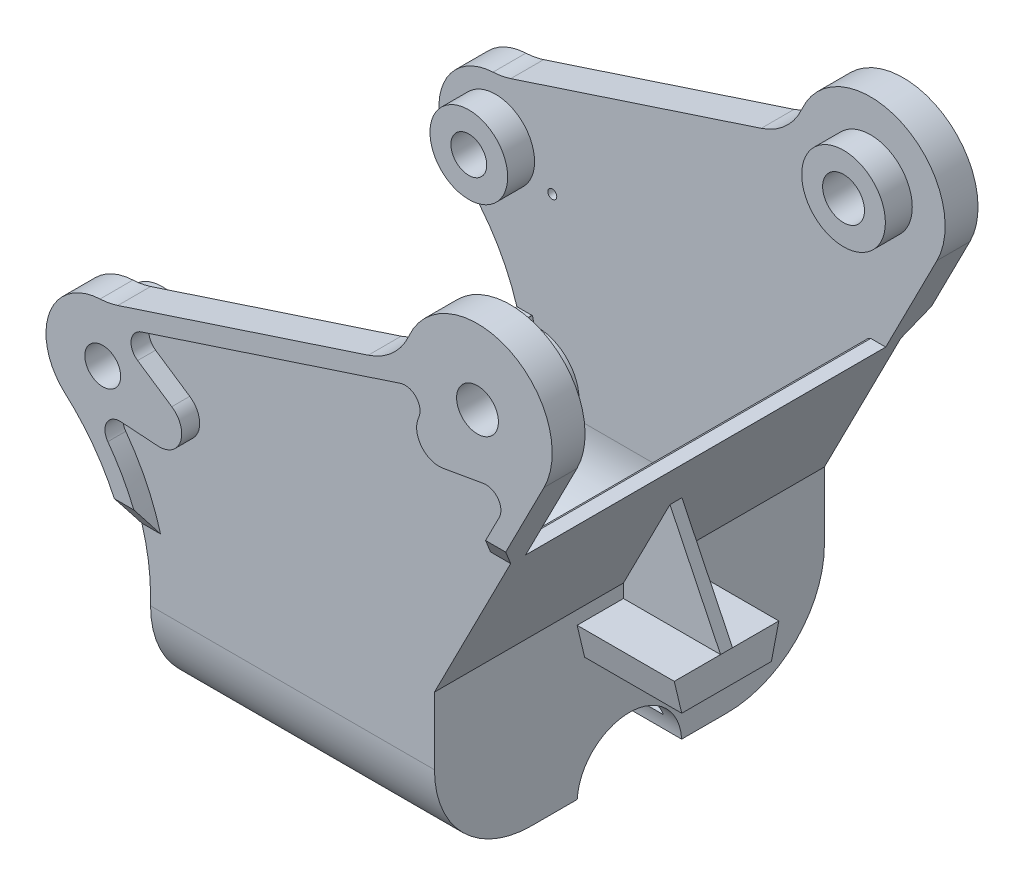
ISO-10303-21;
HEADER;
FILE_DESCRIPTION(('STEP AP214'),'2;1');
FILE_NAME('part.step','',(''),(''),'','','');
FILE_SCHEMA(('AUTOMOTIVE_DESIGN { 1 0 10303 214 1 1 1 1 }'));
ENDSEC;
DATA;
#1=APPLICATION_CONTEXT('core data for automotive mechanical design processes');
#2=APPLICATION_PROTOCOL_DEFINITION('international standard','automotive_design',2000,#1);
#3=PRODUCT_CONTEXT('',#1,'mechanical');
#4=PRODUCT('Part','Part','',(#3));
#5=PRODUCT_RELATED_PRODUCT_CATEGORY('part','',(#4));
#6=PRODUCT_DEFINITION_FORMATION('','',#4);
#7=PRODUCT_DEFINITION_CONTEXT('part definition',#1,'design');
#8=PRODUCT_DEFINITION('design','',#6,#7);
#9=PRODUCT_DEFINITION_SHAPE('','',#8);
#10=(LENGTH_UNIT() NAMED_UNIT(*) SI_UNIT(.MILLI.,.METRE.));
#11=(NAMED_UNIT(*) PLANE_ANGLE_UNIT() SI_UNIT($,.RADIAN.));
#12=(NAMED_UNIT(*) SI_UNIT($,.STERADIAN.) SOLID_ANGLE_UNIT());
#13=UNCERTAINTY_MEASURE_WITH_UNIT(LENGTH_MEASURE(1.E-05),#10,'distance_accuracy_value','');
#14=(GEOMETRIC_REPRESENTATION_CONTEXT(3) GLOBAL_UNCERTAINTY_ASSIGNED_CONTEXT((#13)) GLOBAL_UNIT_ASSIGNED_CONTEXT((#10,
#11,#12)) REPRESENTATION_CONTEXT('',''));
#15=CARTESIAN_POINT('',(0.,0.,0.));
#16=DIRECTION('',(0.,0.,1.));
#17=DIRECTION('',(1.,0.,0.));
#18=AXIS2_PLACEMENT_3D('',#15,#16,#17);
#19=CARTESIAN_POINT('',(-40.7987240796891,-300.,130.5));
#20=DIRECTION('',(0.,1.,0.));
#21=DIRECTION('',(0.,0.,1.));
#22=AXIS2_PLACEMENT_3D('',#19,#20,#21);
#23=PLANE('',#22);
#24=DIRECTION('',(0.,0.,-1.));
#25=VECTOR('',#24,1.);
#26=CARTESIAN_POINT('',(-230.798724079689,-300.,130.5));
#27=LINE('',#26,#25);
#28=CARTESIAN_POINT('',(-230.798724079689,-300.,65.5));
#29=VERTEX_POINT('',#28);
#30=CARTESIAN_POINT('',(-230.798724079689,-300.,34.9428104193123));
#31=VERTEX_POINT('',#30);
#32=EDGE_CURVE('E1039',#29,#31,#27,.T.);
#33=ORIENTED_EDGE('',*,*,#32,.T.);
#34=DIRECTION('',(1.,0.,0.));
#35=VECTOR('',#34,1.);
#36=CARTESIAN_POINT('',(-288.798724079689,-300.,34.9428104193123));
#37=LINE('',#36,#35);
#38=CARTESIAN_POINT('',(-40.7987240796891,-300.,34.9428104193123));
#39=VERTEX_POINT('',#38);
#40=EDGE_CURVE('E1009',#31,#39,#37,.T.);
#41=ORIENTED_EDGE('',*,*,#40,.T.);
#42=DIRECTION('',(0.,0.,-1.));
#43=VECTOR('',#42,1.);
#44=CARTESIAN_POINT('',(-40.7987240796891,-300.,130.5));
#45=LINE('',#44,#43);
#46=CARTESIAN_POINT('',(-40.7987240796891,-300.,65.5));
#47=VERTEX_POINT('',#46);
#48=EDGE_CURVE('E1031',#47,#39,#45,.T.);
#49=ORIENTED_EDGE('',*,*,#48,.F.);
#50=DIRECTION('',(1.,0.,0.));
#51=VECTOR('',#50,1.);
#52=CARTESIAN_POINT('',(-230.798724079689,-300.,65.5));
#53=LINE('',#52,#51);
#54=EDGE_CURVE('E1065',#47,#29,#53,.F.);
#55=ORIENTED_EDGE('',*,*,#54,.T.);
#56=EDGE_LOOP('',(#33,#41,#49,#55));
#57=FACE_BOUND('',#56,.T.);
#58=ADVANCED_FACE('F41',(#57),#23,.F.);
#59=CARTESIAN_POINT('',(-477.9950019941,-289.999998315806,65.5136110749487));
#60=DIRECTION('',(0.,-0.999995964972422,-0.00284078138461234));
#61=DIRECTION('',(0.,0.00284078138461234,-0.999995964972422));
#62=AXIS2_PLACEMENT_3D('',#59,#60,#61);
#63=PLANE('',#62);
#64=DIRECTION('',(0.,-0.00284078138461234,0.999995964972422));
#65=VECTOR('',#64,1.);
#66=CARTESIAN_POINT('',(-220.798724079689,-289.999998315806,65.5136110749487));
#67=LINE('',#66,#65);
#68=CARTESIAN_POINT('',(-220.798724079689,-289.609223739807,-72.0446682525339));
#69=VERTEX_POINT('',#68);
#70=CARTESIAN_POINT('',(-220.798724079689,-289.720779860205,-32.7753070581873));
#71=VERTEX_POINT('',#70);
#72=EDGE_CURVE('E1099',#69,#71,#67,.T.);
#73=ORIENTED_EDGE('',*,*,#72,.T.);
#74=DIRECTION('',(1.,0.,0.));
#75=VECTOR('',#74,1.);
#76=CARTESIAN_POINT('',(-288.798724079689,-289.720779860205,-32.7753070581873));
#77=LINE('',#76,#75);
#78=CARTESIAN_POINT('',(-50.7987240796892,-289.720779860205,-32.7753070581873));
#79=VERTEX_POINT('',#78);
#80=EDGE_CURVE('E65',#71,#79,#77,.T.);
#81=ORIENTED_EDGE('',*,*,#80,.T.);
#82=DIRECTION('',(0.,0.00284078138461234,-0.999995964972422));
#83=VECTOR('',#82,1.);
#84=CARTESIAN_POINT('',(-50.7987240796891,-289.999998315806,65.5136110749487));
#85=LINE('',#84,#83);
#86=CARTESIAN_POINT('',(-50.7987240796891,-289.609223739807,-72.0446682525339));
#87=VERTEX_POINT('',#86);
#88=EDGE_CURVE('E1193',#79,#87,#85,.T.);
#89=ORIENTED_EDGE('',*,*,#88,.T.);
#90=DIRECTION('',(1.,0.,0.));
#91=VECTOR('',#90,1.);
#92=CARTESIAN_POINT('',(-477.9950019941,-289.609223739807,-72.0446682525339));
#93=LINE('',#92,#91);
#94=EDGE_CURVE('E1176',#69,#87,#93,.T.);
#95=ORIENTED_EDGE('',*,*,#94,.F.);
#96=EDGE_LOOP('',(#73,#81,#89,#95));
#97=FACE_BOUND('',#96,.T.);
#98=ADVANCED_FACE('F1197',(#97),#63,.F.);
#99=CARTESIAN_POINT('',(0.,0.,-120.5));
#100=DIRECTION('',(0.,0.,1.));
#101=DIRECTION('',(1.,0.,0.));
#102=AXIS2_PLACEMENT_3D('',#99,#100,#101);
#103=PLANE('',#102);
#104=CARTESIAN_POINT('',(-212.942573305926,-112.919436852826,-120.5));
#105=DIRECTION('',(0.,0.,1.));
#106=DIRECTION('',(1.,0.,0.));
#107=AXIS2_PLACEMENT_3D('',#104,#105,#106);
#108=CIRCLE('',#107,2.99999999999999);
#109=CARTESIAN_POINT('',(-209.942573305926,-112.919436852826,-120.5));
#110=VERTEX_POINT('',#109);
#111=EDGE_CURVE('E1840',#110,#110,#108,.T.);
#112=ORIENTED_EDGE('',*,*,#111,.F.);
#113=EDGE_LOOP('',(#112));
#114=FACE_BOUND('',#113,.T.);
#115=CARTESIAN_POINT('',(-25.7438973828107,-30.6145675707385,-120.5));
#116=DIRECTION('',(0.,0.,1.));
#117=DIRECTION('',(1.,0.,0.));
#118=AXIS2_PLACEMENT_3D('',#115,#116,#117);
#119=CIRCLE('',#118,3.);
#120=CARTESIAN_POINT('',(-22.7438973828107,-30.6145675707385,-120.5));
#121=VERTEX_POINT('',#120);
#122=EDGE_CURVE('E519',#121,#121,#119,.T.);
#123=ORIENTED_EDGE('',*,*,#122,.F.);
#124=EDGE_LOOP('',(#123));
#125=FACE_BOUND('',#124,.T.);
#126=CARTESIAN_POINT('',(0.,0.,-120.5));
#127=DIRECTION('',(0.,0.,1.));
#128=DIRECTION('',(1.,0.,0.));
#129=AXIS2_PLACEMENT_3D('',#126,#127,#128);
#130=CIRCLE('',#129,28.);
#131=CARTESIAN_POINT('',(28.,0.,-120.5));
#132=VERTEX_POINT('',#131);
#133=EDGE_CURVE('E591',#132,#132,#130,.T.);
#134=ORIENTED_EDGE('',*,*,#133,.F.);
#135=EDGE_LOOP('',(#134));
#136=FACE_BOUND('',#135,.T.);
#137=DIRECTION('',(-0.454435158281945,-0.89077981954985,0.));
#138=VECTOR('',#137,1.);
#139=CARTESIAN_POINT('',(-50.7987240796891,-187.596572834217,-120.5));
#140=LINE('',#139,#138);
#141=CARTESIAN_POINT('',(-1.36515951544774,-90.6973322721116,-120.5));
#142=VERTEX_POINT('',#141);
#143=CARTESIAN_POINT('',(-50.7987240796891,-187.596572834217,-120.5));
#144=VERTEX_POINT('',#143);
#145=EDGE_CURVE('E1095',#142,#144,#140,.T.);
#146=ORIENTED_EDGE('',*,*,#145,.F.);
#147=DIRECTION('',(0.915035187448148,0.403374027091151,0.));
#148=VECTOR('',#147,1.);
#149=CARTESIAN_POINT('',(-226.628634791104,-190.,-120.5));
#150=LINE('',#149,#148);
#151=CARTESIAN_POINT('',(0.216706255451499,-90.,-120.5));
#152=VERTEX_POINT('',#151);
#153=EDGE_CURVE('E615',#142,#152,#150,.T.);
#154=ORIENTED_EDGE('',*,*,#153,.T.);
#155=DIRECTION('',(1.,0.,0.));
#156=VECTOR('',#155,1.);
#157=CARTESIAN_POINT('',(10.2167062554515,-90.,-120.5));
#158=LINE('',#157,#156);
#159=CARTESIAN_POINT('',(10.2167062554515,-90.,-120.5));
#160=VERTEX_POINT('',#159);
#161=EDGE_CURVE('E619',#152,#160,#158,.T.);
#162=ORIENTED_EDGE('',*,*,#161,.T.);
#163=DIRECTION('',(-0.454435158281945,-0.89077981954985,0.));
#164=VECTOR('',#163,1.);
#165=CARTESIAN_POINT('',(44.5389909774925,-22.7217579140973,-120.5));
#166=LINE('',#165,#164);
#167=CARTESIAN_POINT('',(44.5389909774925,-22.7217579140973,-120.5));
#168=VERTEX_POINT('',#167);
#169=EDGE_CURVE('E652',#168,#160,#166,.T.);
#170=ORIENTED_EDGE('',*,*,#169,.F.);
#171=CARTESIAN_POINT('',(0.,0.,-120.5));
#172=DIRECTION('',(0.,0.,-1.));
#173=DIRECTION('',(-1.,0.,0.));
#174=AXIS2_PLACEMENT_3D('',#171,#172,#173);
#175=CIRCLE('',#174,50.);
#176=CARTESIAN_POINT('',(-45.8456500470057,19.9543572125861,-120.5));
#177=VERTEX_POINT('',#176);
#178=EDGE_CURVE('E655',#177,#168,#175,.T.);
#179=ORIENTED_EDGE('',*,*,#178,.F.);
#180=CARTESIAN_POINT('',(-87.1067350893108,37.9132787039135,-120.5));
#181=DIRECTION('',(0.,0.,-1.));
#182=DIRECTION('',(-1.,0.,0.));
#183=AXIS2_PLACEMENT_3D('',#180,#181,#182);
#184=CIRCLE('',#183,45.);
#185=CARTESIAN_POINT('',(-73.0759870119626,-4.84345302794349,-120.5));
#186=VERTEX_POINT('',#185);
#187=EDGE_CURVE('E658',#186,#177,#184,.F.);
#188=ORIENTED_EDGE('',*,*,#187,.F.);
#189=DIRECTION('',(0.950149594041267,0.31179440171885,0.));
#190=VECTOR('',#189,1.);
#191=CARTESIAN_POINT('',(-240.700542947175,-59.8499472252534,-120.5));
#192=LINE('',#191,#190);
#193=CARTESIAN_POINT('',(-240.700542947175,-59.8499472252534,-120.5));
#194=VERTEX_POINT('',#193);
#195=EDGE_CURVE('E661',#194,#186,#192,.T.);
#196=ORIENTED_EDGE('',*,*,#195,.F.);
#197=CARTESIAN_POINT('',(-254.731291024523,-17.0932154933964,-120.5));
#198=DIRECTION('',(0.,0.,-1.));
#199=DIRECTION('',(-1.,0.,0.));
#200=AXIS2_PLACEMENT_3D('',#197,#198,#199);
#201=CIRCLE('',#200,45.);
#202=CARTESIAN_POINT('',(-252.599176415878,-62.0426769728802,-120.5));
#203=VERTEX_POINT('',#202);
#204=EDGE_CURVE('E664',#203,#194,#201,.F.);
#205=ORIENTED_EDGE('',*,*,#204,.F.);
#206=CARTESIAN_POINT('',(-250.798724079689,-99.9999999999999,-120.5));
#207=DIRECTION('',(0.,0.,-1.));
#208=DIRECTION('',(-1.,0.,0.));
#209=AXIS2_PLACEMENT_3D('',#206,#207,#208);
#210=CIRCLE('',#209,38.);
#211=CARTESIAN_POINT('',(-276.058839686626,-128.388845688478,-120.5));
#212=VERTEX_POINT('',#211);
#213=EDGE_CURVE('E667',#212,#203,#210,.T.);
#214=ORIENTED_EDGE('',*,*,#213,.F.);
#215=CARTESIAN_POINT('',(-365.798724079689,-229.243955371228,-120.5));
#216=DIRECTION('',(0.,0.,-1.));
#217=DIRECTION('',(-1.,0.,0.));
#218=AXIS2_PLACEMENT_3D('',#215,#216,#217);
#219=CIRCLE('',#218,135.);
#220=CARTESIAN_POINT('',(-236.628634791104,-190.,-120.5));
#221=VERTEX_POINT('',#220);
#222=EDGE_CURVE('E670',#221,#212,#219,.F.);
#223=ORIENTED_EDGE('',*,*,#222,.F.);
#224=DIRECTION('',(1.,0.,0.));
#225=VECTOR('',#224,1.);
#226=CARTESIAN_POINT('',(-236.628634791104,-190.,-120.5));
#227=LINE('',#226,#225);
#228=CARTESIAN_POINT('',(-226.628634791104,-190.,-120.5));
#229=VERTEX_POINT('',#228);
#230=EDGE_CURVE('E612',#221,#229,#227,.T.);
#231=ORIENTED_EDGE('',*,*,#230,.T.);
#232=CARTESIAN_POINT('',(-226.256573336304,-189.835984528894,-120.5));
#233=VERTEX_POINT('',#232);
#234=EDGE_CURVE('E616',#229,#233,#150,.T.);
#235=ORIENTED_EDGE('',*,*,#234,.T.);
#236=CARTESIAN_POINT('',(-365.798724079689,-229.243955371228,-120.5));
#237=DIRECTION('',(0.,0.,1.));
#238=DIRECTION('',(1.,0.,0.));
#239=AXIS2_PLACEMENT_3D('',#236,#237,#238);
#240=CIRCLE('',#239,145.);
#241=CARTESIAN_POINT('',(-220.860844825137,-225.,-120.5));
#242=VERTEX_POINT('',#241);
#243=EDGE_CURVE('E1087',#242,#233,#240,.T.);
#244=ORIENTED_EDGE('',*,*,#243,.F.);
#245=DIRECTION('',(-1.,0.,0.));
#246=VECTOR('',#245,1.);
#247=CARTESIAN_POINT('',(-220.860844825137,-225.,-120.5));
#248=LINE('',#247,#246);
#249=CARTESIAN_POINT('',(-220.798724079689,-225.,-120.5));
#250=VERTEX_POINT('',#249);
#251=EDGE_CURVE('E1083',#250,#242,#248,.T.);
#252=ORIENTED_EDGE('',*,*,#251,.F.);
#253=DIRECTION('',(0.,-1.,0.));
#254=VECTOR('',#253,1.);
#255=CARTESIAN_POINT('',(-220.798724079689,-235.,-120.5));
#256=LINE('',#255,#254);
#257=CARTESIAN_POINT('',(-220.798724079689,-235.,-120.5));
#258=VERTEX_POINT('',#257);
#259=EDGE_CURVE('E929',#250,#258,#256,.T.);
#260=ORIENTED_EDGE('',*,*,#259,.T.);
#261=DIRECTION('',(1.,0.,0.));
#262=VECTOR('',#261,1.);
#263=CARTESIAN_POINT('',(-477.9950019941,-235.,-120.5));
#264=LINE('',#263,#262);
#265=CARTESIAN_POINT('',(-50.7987240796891,-235.,-120.5));
#266=VERTEX_POINT('',#265);
#267=EDGE_CURVE('E1174',#258,#266,#264,.T.);
#268=ORIENTED_EDGE('',*,*,#267,.T.);
#269=DIRECTION('',(0.,-1.,0.));
#270=VECTOR('',#269,1.);
#271=CARTESIAN_POINT('',(-50.7987240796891,-225.,-120.5));
#272=LINE('',#271,#270);
#273=EDGE_CURVE('E1086',#144,#266,#272,.T.);
#274=ORIENTED_EDGE('',*,*,#273,.F.);
#275=EDGE_LOOP('',(#146,#154,#162,#170,#179,#188,#196,#205,#214,#223,#231,#235,#244,#252,#260,
#268,#274));
#276=FACE_BOUND('',#275,.T.);
#277=CARTESIAN_POINT('',(-250.798724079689,-99.9999999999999,-120.5));
#278=DIRECTION('',(0.,0.,1.));
#279=DIRECTION('',(1.,0.,0.));
#280=AXIS2_PLACEMENT_3D('',#277,#278,#279);
#281=CIRCLE('',#280,26.);
#282=CARTESIAN_POINT('',(-224.798724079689,-99.9999999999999,-120.5));
#283=VERTEX_POINT('',#282);
#284=EDGE_CURVE('E585',#283,#283,#281,.T.);
#285=ORIENTED_EDGE('',*,*,#284,.F.);
#286=EDGE_LOOP('',(#285));
#287=FACE_BOUND('',#286,.T.);
#288=ADVANCED_FACE('F1219',(#114,#125,#136,#276,#287),#103,.T.);
#289=CARTESIAN_POINT('',(-87.1067350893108,37.9132787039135,120.5));
#290=DIRECTION('',(0.,0.,1.));
#291=DIRECTION('',(1.,0.,0.));
#292=AXIS2_PLACEMENT_3D('',#289,#290,#291);
#293=PLANE('',#292);
#294=CARTESIAN_POINT('',(0.,0.,120.5));
#295=DIRECTION('',(0.,0.,1.));
#296=DIRECTION('',(1.,0.,0.));
#297=AXIS2_PLACEMENT_3D('',#294,#295,#296);
#298=CIRCLE('',#297,28.);
#299=CARTESIAN_POINT('',(28.,0.,120.5));
#300=VERTEX_POINT('',#299);
#301=EDGE_CURVE('E973',#300,#300,#298,.F.);
#302=ORIENTED_EDGE('',*,*,#301,.F.);
#303=EDGE_LOOP('',(#302));
#304=FACE_BOUND('',#303,.T.);
#305=CARTESIAN_POINT('',(-365.798724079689,-229.243955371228,120.5));
#306=DIRECTION('',(0.,0.,-1.));
#307=DIRECTION('',(1.,0.,0.));
#308=AXIS2_PLACEMENT_3D('',#305,#306,#307);
#309=CIRCLE('',#308,145.);
#310=CARTESIAN_POINT('',(-226.256573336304,-189.835984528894,120.5));
#311=VERTEX_POINT('',#310);
#312=CARTESIAN_POINT('',(-220.860844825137,-225.,120.5));
#313=VERTEX_POINT('',#312);
#314=EDGE_CURVE('E1098',#311,#313,#309,.T.);
#315=ORIENTED_EDGE('',*,*,#314,.F.);
#316=DIRECTION('',(0.915035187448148,0.403374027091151,0.));
#317=VECTOR('',#316,1.);
#318=CARTESIAN_POINT('',(-226.628634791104,-190.,120.5));
#319=LINE('',#318,#317);
#320=CARTESIAN_POINT('',(-226.628634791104,-190.,120.5));
#321=VERTEX_POINT('',#320);
#322=EDGE_CURVE('E607',#321,#311,#319,.T.);
#323=ORIENTED_EDGE('',*,*,#322,.F.);
#324=DIRECTION('',(1.,0.,0.));
#325=VECTOR('',#324,1.);
#326=CARTESIAN_POINT('',(-236.628634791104,-190.,120.5));
#327=LINE('',#326,#325);
#328=CARTESIAN_POINT('',(-236.628634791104,-190.,120.5));
#329=VERTEX_POINT('',#328);
#330=EDGE_CURVE('E603',#329,#321,#327,.T.);
#331=ORIENTED_EDGE('',*,*,#330,.F.);
#332=CARTESIAN_POINT('',(-365.798724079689,-229.243955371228,120.5));
#333=DIRECTION('',(0.,0.,-1.));
#334=DIRECTION('',(-1.,0.,0.));
#335=AXIS2_PLACEMENT_3D('',#332,#333,#334);
#336=CIRCLE('',#335,135.);
#337=CARTESIAN_POINT('',(-276.058839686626,-128.388845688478,120.5));
#338=VERTEX_POINT('',#337);
#339=EDGE_CURVE('E650',#329,#338,#336,.F.);
#340=ORIENTED_EDGE('',*,*,#339,.T.);
#341=CARTESIAN_POINT('',(-250.798724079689,-99.9999999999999,120.5));
#342=DIRECTION('',(0.,0.,-1.));
#343=DIRECTION('',(-1.,0.,0.));
#344=AXIS2_PLACEMENT_3D('',#341,#342,#343);
#345=CIRCLE('',#344,38.);
#346=CARTESIAN_POINT('',(-252.599176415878,-62.0426769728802,120.5));
#347=VERTEX_POINT('',#346);
#348=EDGE_CURVE('E648',#338,#347,#345,.T.);
#349=ORIENTED_EDGE('',*,*,#348,.T.);
#350=CARTESIAN_POINT('',(-254.731291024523,-17.0932154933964,120.5));
#351=DIRECTION('',(0.,0.,-1.));
#352=DIRECTION('',(-1.,0.,0.));
#353=AXIS2_PLACEMENT_3D('',#350,#351,#352);
#354=CIRCLE('',#353,45.);
#355=CARTESIAN_POINT('',(-240.700542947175,-59.8499472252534,120.5));
#356=VERTEX_POINT('',#355);
#357=EDGE_CURVE('E646',#347,#356,#354,.F.);
#358=ORIENTED_EDGE('',*,*,#357,.T.);
#359=DIRECTION('',(0.950149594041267,0.31179440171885,0.));
#360=VECTOR('',#359,1.);
#361=CARTESIAN_POINT('',(-240.700542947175,-59.8499472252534,120.5));
#362=LINE('',#361,#360);
#363=CARTESIAN_POINT('',(-73.0759870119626,-4.84345302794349,120.5));
#364=VERTEX_POINT('',#363);
#365=EDGE_CURVE('E644',#356,#364,#362,.T.);
#366=ORIENTED_EDGE('',*,*,#365,.T.);
#367=CARTESIAN_POINT('',(-87.1067350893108,37.9132787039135,120.5));
#368=DIRECTION('',(0.,0.,-1.));
#369=DIRECTION('',(-1.,0.,0.));
#370=AXIS2_PLACEMENT_3D('',#367,#368,#369);
#371=CIRCLE('',#370,45.);
#372=CARTESIAN_POINT('',(-45.8456500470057,19.9543572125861,120.5));
#373=VERTEX_POINT('',#372);
#374=EDGE_CURVE('E642',#364,#373,#371,.F.);
#375=ORIENTED_EDGE('',*,*,#374,.T.);
#376=CARTESIAN_POINT('',(0.,0.,120.5));
#377=DIRECTION('',(0.,0.,-1.));
#378=DIRECTION('',(-1.,0.,0.));
#379=AXIS2_PLACEMENT_3D('',#376,#377,#378);
#380=CIRCLE('',#379,50.);
#381=CARTESIAN_POINT('',(44.5389909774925,-22.7217579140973,120.5));
#382=VERTEX_POINT('',#381);
#383=EDGE_CURVE('E640',#373,#382,#380,.T.);
#384=ORIENTED_EDGE('',*,*,#383,.T.);
#385=DIRECTION('',(-0.454435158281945,-0.89077981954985,0.));
#386=VECTOR('',#385,1.);
#387=CARTESIAN_POINT('',(44.5389909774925,-22.7217579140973,120.5));
#388=LINE('',#387,#386);
#389=CARTESIAN_POINT('',(10.2167062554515,-90.,120.5));
#390=VERTEX_POINT('',#389);
#391=EDGE_CURVE('E638',#382,#390,#388,.T.);
#392=ORIENTED_EDGE('',*,*,#391,.T.);
#393=DIRECTION('',(1.,0.,0.));
#394=VECTOR('',#393,1.);
#395=CARTESIAN_POINT('',(10.2167062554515,-90.,120.5));
#396=LINE('',#395,#394);
#397=CARTESIAN_POINT('',(0.216706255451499,-90.,120.5));
#398=VERTEX_POINT('',#397);
#399=EDGE_CURVE('E609',#398,#390,#396,.T.);
#400=ORIENTED_EDGE('',*,*,#399,.F.);
#401=CARTESIAN_POINT('',(-1.36515951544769,-90.6973322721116,120.5));
#402=VERTEX_POINT('',#401);
#403=EDGE_CURVE('E606',#402,#398,#319,.T.);
#404=ORIENTED_EDGE('',*,*,#403,.F.);
#405=DIRECTION('',(0.454435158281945,0.89077981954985,0.));
#406=VECTOR('',#405,1.);
#407=CARTESIAN_POINT('',(-50.7987240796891,-187.596572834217,120.5));
#408=LINE('',#407,#406);
#409=CARTESIAN_POINT('',(-50.7987240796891,-187.596572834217,120.5));
#410=VERTEX_POINT('',#409);
#411=EDGE_CURVE('E1105',#410,#402,#408,.T.);
#412=ORIENTED_EDGE('',*,*,#411,.F.);
#413=DIRECTION('',(0.,1.,0.));
#414=VECTOR('',#413,1.);
#415=CARTESIAN_POINT('',(-50.7987240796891,-225.,120.5));
#416=LINE('',#415,#414);
#417=CARTESIAN_POINT('',(-50.7987240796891,-235.,120.5));
#418=VERTEX_POINT('',#417);
#419=EDGE_CURVE('E1102',#418,#410,#416,.T.);
#420=ORIENTED_EDGE('',*,*,#419,.F.);
#421=DIRECTION('',(1.,0.,0.));
#422=VECTOR('',#421,1.);
#423=CARTESIAN_POINT('',(-477.9950019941,-235.,120.5));
#424=LINE('',#423,#422);
#425=CARTESIAN_POINT('',(-220.798724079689,-235.,120.5));
#426=VERTEX_POINT('',#425);
#427=EDGE_CURVE('E1167',#426,#418,#424,.T.);
#428=ORIENTED_EDGE('',*,*,#427,.F.);
#429=DIRECTION('',(0.,1.,0.));
#430=VECTOR('',#429,1.);
#431=CARTESIAN_POINT('',(-220.798724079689,-235.,120.5));
#432=LINE('',#431,#430);
#433=CARTESIAN_POINT('',(-220.798724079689,-225.,120.5));
#434=VERTEX_POINT('',#433);
#435=EDGE_CURVE('E939',#426,#434,#432,.T.);
#436=ORIENTED_EDGE('',*,*,#435,.T.);
#437=DIRECTION('',(1.,0.,0.));
#438=VECTOR('',#437,1.);
#439=CARTESIAN_POINT('',(-220.860844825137,-225.,120.5));
#440=LINE('',#439,#438);
#441=EDGE_CURVE('E1088',#313,#434,#440,.T.);
#442=ORIENTED_EDGE('',*,*,#441,.F.);
#443=EDGE_LOOP('',(#315,#323,#331,#340,#349,#358,#366,#375,#384,#392,#400,#404,#412,#420,#428,
#436,#442));
#444=FACE_BOUND('',#443,.T.);
#445=CARTESIAN_POINT('',(-250.798724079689,-99.9999999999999,120.5));
#446=DIRECTION('',(0.,0.,1.));
#447=DIRECTION('',(1.,0.,0.));
#448=AXIS2_PLACEMENT_3D('',#445,#446,#447);
#449=CIRCLE('',#448,26.);
#450=CARTESIAN_POINT('',(-224.798724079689,-99.9999999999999,120.5));
#451=VERTEX_POINT('',#450);
#452=EDGE_CURVE('E50',#451,#451,#449,.F.);
#453=ORIENTED_EDGE('',*,*,#452,.F.);
#454=EDGE_LOOP('',(#453));
#455=FACE_BOUND('',#454,.T.);
#456=ADVANCED_FACE('F1142',(#304,#444,#455),#293,.F.);
#457=CARTESIAN_POINT('',(0.,0.,130.5));
#458=DIRECTION('',(0.,0.,-1.));
#459=DIRECTION('',(-1.,0.,0.));
#460=AXIS2_PLACEMENT_3D('',#457,#458,#459);
#461=CYLINDRICAL_SURFACE('',#460,50.);
#462=ORIENTED_EDGE('',*,*,#383,.F.);
#463=DIRECTION('',(0.,0.,-1.));
#464=VECTOR('',#463,1.);
#465=CARTESIAN_POINT('',(-45.8456500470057,19.9543572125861,130.5));
#466=LINE('',#465,#464);
#467=CARTESIAN_POINT('',(-45.8456500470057,19.9543572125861,142.5));
#468=VERTEX_POINT('',#467);
#469=EDGE_CURVE('E1062',#468,#373,#466,.T.);
#470=ORIENTED_EDGE('',*,*,#469,.F.);
#471=CARTESIAN_POINT('',(0.,0.,142.5));
#472=DIRECTION('',(0.,0.,1.));
#473=DIRECTION('',(1.,0.,0.));
#474=AXIS2_PLACEMENT_3D('',#471,#472,#473);
#475=CIRCLE('',#474,50.);
#476=CARTESIAN_POINT('',(44.5389909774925,-22.7217579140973,142.5));
#477=VERTEX_POINT('',#476);
#478=EDGE_CURVE('E846',#477,#468,#475,.T.);
#479=ORIENTED_EDGE('',*,*,#478,.F.);
#480=DIRECTION('',(0.,0.,-1.));
#481=VECTOR('',#480,1.);
#482=CARTESIAN_POINT('',(44.5389909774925,-22.7217579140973,130.5));
#483=LINE('',#482,#481);
#484=EDGE_CURVE('E1033',#477,#382,#483,.T.);
#485=ORIENTED_EDGE('',*,*,#484,.T.);
#486=EDGE_LOOP('',(#462,#470,#479,#485));
#487=FACE_BOUND('',#486,.T.);
#488=ADVANCED_FACE('F1136',(#487),#461,.T.);
#489=CARTESIAN_POINT('',(-87.1067350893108,37.9132787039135,130.5));
#490=DIRECTION('',(0.,0.,-1.));
#491=DIRECTION('',(-1.,0.,0.));
#492=AXIS2_PLACEMENT_3D('',#489,#490,#491);
#493=CYLINDRICAL_SURFACE('',#492,45.);
#494=ORIENTED_EDGE('',*,*,#374,.F.);
#495=DIRECTION('',(0.,0.,-1.));
#496=VECTOR('',#495,1.);
#497=CARTESIAN_POINT('',(-73.0759870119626,-4.84345302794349,130.5));
#498=LINE('',#497,#496);
#499=CARTESIAN_POINT('',(-73.0759870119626,-4.84345302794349,142.5));
#500=VERTEX_POINT('',#499);
#501=EDGE_CURVE('E1058',#500,#364,#498,.T.);
#502=ORIENTED_EDGE('',*,*,#501,.F.);
#503=CARTESIAN_POINT('',(-87.1067350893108,37.9132787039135,142.5));
#504=DIRECTION('',(0.,0.,-1.));
#505=DIRECTION('',(1.,0.,0.));
#506=AXIS2_PLACEMENT_3D('',#503,#504,#505);
#507=CIRCLE('',#506,45.);
#508=EDGE_CURVE('E849',#468,#500,#507,.T.);
#509=ORIENTED_EDGE('',*,*,#508,.F.);
#510=ORIENTED_EDGE('',*,*,#469,.T.);
#511=EDGE_LOOP('',(#494,#502,#509,#510));
#512=FACE_BOUND('',#511,.T.);
#513=ADVANCED_FACE('F1685',(#512),#493,.F.);
#514=CARTESIAN_POINT('',(-240.700542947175,-59.8499472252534,130.5));
#515=DIRECTION('',(0.31179440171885,-0.950149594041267,0.));
#516=DIRECTION('',(0.950149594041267,0.31179440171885,0.));
#517=AXIS2_PLACEMENT_3D('',#514,#515,#516);
#518=PLANE('',#517);
#519=ORIENTED_EDGE('',*,*,#365,.F.);
#520=DIRECTION('',(0.,0.,-1.));
#521=VECTOR('',#520,1.);
#522=CARTESIAN_POINT('',(-240.700542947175,-59.8499472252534,130.5));
#523=LINE('',#522,#521);
#524=CARTESIAN_POINT('',(-240.700542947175,-59.8499472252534,142.5));
#525=VERTEX_POINT('',#524);
#526=EDGE_CURVE('E1054',#525,#356,#523,.T.);
#527=ORIENTED_EDGE('',*,*,#526,.F.);
#528=DIRECTION('',(-0.950149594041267,-0.31179440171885,0.));
#529=VECTOR('',#528,1.);
#530=CARTESIAN_POINT('',(-73.0759870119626,-4.84345302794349,142.5));
#531=LINE('',#530,#529);
#532=EDGE_CURVE('E852',#500,#525,#531,.T.);
#533=ORIENTED_EDGE('',*,*,#532,.F.);
#534=ORIENTED_EDGE('',*,*,#501,.T.);
#535=EDGE_LOOP('',(#519,#527,#533,#534));
#536=FACE_BOUND('',#535,.T.);
#537=ADVANCED_FACE('F1678',(#536),#518,.F.);
#538=CARTESIAN_POINT('',(-254.731291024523,-17.0932154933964,130.5));
#539=DIRECTION('',(0.,0.,-1.));
#540=DIRECTION('',(-1.,0.,0.));
#541=AXIS2_PLACEMENT_3D('',#538,#539,#540);
#542=CYLINDRICAL_SURFACE('',#541,45.);
#543=ORIENTED_EDGE('',*,*,#357,.F.);
#544=DIRECTION('',(0.,0.,-1.));
#545=VECTOR('',#544,1.);
#546=CARTESIAN_POINT('',(-252.599176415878,-62.0426769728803,130.5));
#547=LINE('',#546,#545);
#548=CARTESIAN_POINT('',(-252.599176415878,-62.0426769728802,142.5));
#549=VERTEX_POINT('',#548);
#550=EDGE_CURVE('E1050',#549,#347,#547,.T.);
#551=ORIENTED_EDGE('',*,*,#550,.F.);
#552=CARTESIAN_POINT('',(-254.731291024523,-17.0932154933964,142.5));
#553=DIRECTION('',(0.,0.,-1.));
#554=DIRECTION('',(1.,0.,0.));
#555=AXIS2_PLACEMENT_3D('',#552,#553,#554);
#556=CIRCLE('',#555,45.);
#557=EDGE_CURVE('E855',#525,#549,#556,.T.);
#558=ORIENTED_EDGE('',*,*,#557,.F.);
#559=ORIENTED_EDGE('',*,*,#526,.T.);
#560=EDGE_LOOP('',(#543,#551,#558,#559));
#561=FACE_BOUND('',#560,.T.);
#562=ADVANCED_FACE('F1681',(#561),#542,.F.);
#563=CARTESIAN_POINT('',(-250.798724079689,-99.9999999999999,130.5));
#564=DIRECTION('',(0.,0.,-1.));
#565=DIRECTION('',(-1.,0.,0.));
#566=AXIS2_PLACEMENT_3D('',#563,#564,#565);
#567=CYLINDRICAL_SURFACE('',#566,38.);
#568=ORIENTED_EDGE('',*,*,#348,.F.);
#569=DIRECTION('',(0.,0.,-1.));
#570=VECTOR('',#569,1.);
#571=CARTESIAN_POINT('',(-276.058839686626,-128.388845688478,130.5));
#572=LINE('',#571,#570);
#573=CARTESIAN_POINT('',(-276.058839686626,-128.388845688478,142.5));
#574=VERTEX_POINT('',#573);
#575=EDGE_CURVE('E1046',#574,#338,#572,.T.);
#576=ORIENTED_EDGE('',*,*,#575,.F.);
#577=CARTESIAN_POINT('',(-250.798724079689,-99.9999999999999,142.5));
#578=DIRECTION('',(0.,0.,1.));
#579=DIRECTION('',(1.,0.,0.));
#580=AXIS2_PLACEMENT_3D('',#577,#578,#579);
#581=CIRCLE('',#580,38.);
#582=EDGE_CURVE('E858',#549,#574,#581,.T.);
#583=ORIENTED_EDGE('',*,*,#582,.F.);
#584=ORIENTED_EDGE('',*,*,#550,.T.);
#585=EDGE_LOOP('',(#568,#576,#583,#584));
#586=FACE_BOUND('',#585,.T.);
#587=ADVANCED_FACE('F1389',(#586),#567,.T.);
#588=CARTESIAN_POINT('',(0.,0.,130.5));
#589=DIRECTION('',(0.,0.,1.));
#590=DIRECTION('',(1.,0.,0.));
#591=AXIS2_PLACEMENT_3D('',#588,#589,#590);
#592=PLANE('',#591);
#593=CARTESIAN_POINT('',(-365.798724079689,-229.243955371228,130.5));
#594=DIRECTION('',(0.,0.,1.));
#595=DIRECTION('',(1.,0.,0.));
#596=AXIS2_PLACEMENT_3D('',#593,#594,#595);
#597=CIRCLE('',#596,147.);
#598=CARTESIAN_POINT('',(-224.133936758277,-190.,130.5));
#599=VERTEX_POINT('',#598);
#600=CARTESIAN_POINT('',(-247.392973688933,-142.128639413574,130.5));
#601=VERTEX_POINT('',#600);
#602=EDGE_CURVE('E804',#599,#601,#597,.T.);
#603=ORIENTED_EDGE('',*,*,#602,.F.);
#604=DIRECTION('',(1.,0.,0.));
#605=VECTOR('',#604,1.);
#606=CARTESIAN_POINT('',(-236.628634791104,-190.,130.5));
#607=LINE('',#606,#605);
#608=CARTESIAN_POINT('',(-236.628634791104,-190.,130.5));
#609=VERTEX_POINT('',#608);
#610=EDGE_CURVE('E801',#609,#599,#607,.T.);
#611=ORIENTED_EDGE('',*,*,#610,.F.);
#612=CARTESIAN_POINT('',(-365.798724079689,-229.243955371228,130.5));
#613=DIRECTION('',(0.,0.,-1.));
#614=DIRECTION('',(-1.,0.,0.));
#615=AXIS2_PLACEMENT_3D('',#612,#613,#614);
#616=CIRCLE('',#615,135.);
#617=CARTESIAN_POINT('',(-230.798724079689,-229.243955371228,130.5));
#618=VERTEX_POINT('',#617);
#619=EDGE_CURVE('E1121',#609,#618,#616,.T.);
#620=ORIENTED_EDGE('',*,*,#619,.T.);
#621=DIRECTION('',(0.,-1.,0.));
#622=VECTOR('',#621,1.);
#623=CARTESIAN_POINT('',(-230.798724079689,-300.,130.5));
#624=LINE('',#623,#622);
#625=CARTESIAN_POINT('',(-230.798724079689,-235.,130.5));
#626=VERTEX_POINT('',#625);
#627=EDGE_CURVE('E1123',#618,#626,#624,.T.);
#628=ORIENTED_EDGE('',*,*,#627,.T.);
#629=DIRECTION('',(1.,0.,0.));
#630=VECTOR('',#629,1.);
#631=CARTESIAN_POINT('',(-40.7987240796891,-235.,130.5));
#632=LINE('',#631,#630);
#633=CARTESIAN_POINT('',(-40.7987240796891,-235.,130.5));
#634=VERTEX_POINT('',#633);
#635=EDGE_CURVE('E949',#626,#634,#632,.T.);
#636=ORIENTED_EDGE('',*,*,#635,.T.);
#637=DIRECTION('',(0.,1.,0.));
#638=VECTOR('',#637,1.);
#639=CARTESIAN_POINT('',(-40.7987240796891,-190.,130.5));
#640=LINE('',#639,#638);
#641=CARTESIAN_POINT('',(-40.7987240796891,-190.,130.5));
#642=VERTEX_POINT('',#641);
#643=EDGE_CURVE('E1126',#634,#642,#640,.T.);
#644=ORIENTED_EDGE('',*,*,#643,.T.);
#645=DIRECTION('',(0.454435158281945,0.89077981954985,0.));
#646=VECTOR('',#645,1.);
#647=CARTESIAN_POINT('',(44.5389909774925,-22.7217579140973,130.5));
#648=LINE('',#647,#646);
#649=CARTESIAN_POINT('',(10.2167062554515,-90.,130.5));
#650=VERTEX_POINT('',#649);
#651=EDGE_CURVE('E1026',#642,#650,#648,.T.);
#652=ORIENTED_EDGE('',*,*,#651,.T.);
#653=DIRECTION('',(1.,0.,0.));
#654=VECTOR('',#653,1.);
#655=CARTESIAN_POINT('',(-3.25463619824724,-90.,130.5));
#656=LINE('',#655,#654);
#657=CARTESIAN_POINT('',(-3.25463619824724,-90.,130.5));
#658=VERTEX_POINT('',#657);
#659=EDGE_CURVE('E843',#658,#650,#656,.T.);
#660=ORIENTED_EDGE('',*,*,#659,.F.);
#661=DIRECTION('',(-0.454435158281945,-0.89077981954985,0.));
#662=VECTOR('',#661,1.);
#663=CARTESIAN_POINT('',(14.5834116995,-55.0340146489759,130.5));
#664=LINE('',#663,#662);
#665=CARTESIAN_POINT('',(14.5834116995,-55.0340146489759,130.5));
#666=VERTEX_POINT('',#665);
#667=EDGE_CURVE('E840',#666,#658,#664,.T.);
#668=ORIENTED_EDGE('',*,*,#667,.F.);
#669=CARTESIAN_POINT('',(5.67561350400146,-50.4896630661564,130.5));
#670=DIRECTION('',(0.,0.,-1.));
#671=DIRECTION('',(-1.,0.,0.));
#672=AXIS2_PLACEMENT_3D('',#669,#670,#671);
#673=CIRCLE('',#672,10.);
#674=CARTESIAN_POINT('',(3.94954822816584,-40.6397545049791,130.5));
#675=VERTEX_POINT('',#674);
#676=EDGE_CURVE('E837',#675,#666,#673,.T.);
#677=ORIENTED_EDGE('',*,*,#676,.F.);
#678=DIRECTION('',(0.984990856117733,0.172606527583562,0.));
#679=VECTOR('',#678,1.);
#680=CARTESIAN_POINT('',(-23.1547994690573,-45.3894304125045,130.5));
#681=LINE('',#680,#679);
#682=CARTESIAN_POINT('',(-23.1547994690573,-45.3894304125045,130.5));
#683=VERTEX_POINT('',#682);
#684=EDGE_CURVE('E834',#683,#675,#681,.T.);
#685=ORIENTED_EDGE('',*,*,#684,.F.);
#686=CARTESIAN_POINT('',(-25.7438973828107,-30.6145675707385,130.5));
#687=DIRECTION('',(0.,0.,1.));
#688=DIRECTION('',(1.,0.,0.));
#689=AXIS2_PLACEMENT_3D('',#686,#687,#688);
#690=CIRCLE('',#689,15.);
#691=CARTESIAN_POINT('',(-39.8338528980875,-25.4693607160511,130.5));
#692=VERTEX_POINT('',#691);
#693=EDGE_CURVE('E831',#692,#683,#690,.T.);
#694=ORIENTED_EDGE('',*,*,#693,.F.);
#695=DIRECTION('',(-0.343013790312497,-0.939330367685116,0.));
#696=VECTOR('',#695,1.);
#697=CARTESIAN_POINT('',(-39.8338528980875,-25.4693607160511,130.5));
#698=LINE('',#697,#696);
#699=CARTESIAN_POINT('',(-39.0590206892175,-23.3475118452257,130.5));
#700=VERTEX_POINT('',#699);
#701=EDGE_CURVE('E828',#700,#692,#698,.T.);
#702=ORIENTED_EDGE('',*,*,#701,.F.);
#703=CARTESIAN_POINT('',(-48.4523243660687,-19.9173739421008,130.5));
#704=DIRECTION('',(0.,0.,-1.));
#705=DIRECTION('',(-1.,0.,0.));
#706=AXIS2_PLACEMENT_3D('',#703,#704,#705);
#707=CIRCLE('',#706,10.);
#708=CARTESIAN_POINT('',(-51.5702683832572,-10.4158780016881,130.5));
#709=VERTEX_POINT('',#708);
#710=EDGE_CURVE('E825',#709,#700,#707,.T.);
#711=ORIENTED_EDGE('',*,*,#710,.F.);
#712=DIRECTION('',(0.950149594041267,0.31179440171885,0.));
#713=VECTOR('',#712,1.);
#714=CARTESIAN_POINT('',(-69.3344541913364,-16.2452481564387,130.5));
#715=LINE('',#714,#713);
#716=CARTESIAN_POINT('',(-224.99612092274,-67.3260848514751,130.5));
#717=VERTEX_POINT('',#716);
#718=EDGE_CURVE('E822',#717,#709,#715,.T.);
#719=ORIENTED_EDGE('',*,*,#718,.F.);
#720=CARTESIAN_POINT('',(-221.878176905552,-76.8275807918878,130.5));
#721=DIRECTION('',(0.,0.,-1.));
#722=DIRECTION('',(-1.,0.,0.));
#723=AXIS2_PLACEMENT_3D('',#720,#721,#722);
#724=CIRCLE('',#723,10.);
#725=CARTESIAN_POINT('',(-227.447454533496,-85.1331901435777,130.5));
#726=VERTEX_POINT('',#725);
#727=EDGE_CURVE('E819',#726,#717,#724,.T.);
#728=ORIENTED_EDGE('',*,*,#727,.F.);
#729=DIRECTION('',(-0.830560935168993,0.556927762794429,0.));
#730=VECTOR('',#729,1.);
#731=CARTESIAN_POINT('',(-204.58865686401,-100.461022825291,130.5));
#732=LINE('',#731,#730);
#733=CARTESIAN_POINT('',(-204.58865686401,-100.461022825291,130.5));
#734=VERTEX_POINT('',#733);
#735=EDGE_CURVE('E816',#734,#726,#732,.T.);
#736=ORIENTED_EDGE('',*,*,#735,.F.);
#737=CARTESIAN_POINT('',(-212.942573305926,-112.919436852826,130.5));
#738=DIRECTION('',(0.,0.,1.));
#739=DIRECTION('',(1.,0.,0.));
#740=AXIS2_PLACEMENT_3D('',#737,#738,#739);
#741=CIRCLE('',#740,15.);
#742=CARTESIAN_POINT('',(-213.948070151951,-127.885698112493,130.5));
#743=VERTEX_POINT('',#742);
#744=EDGE_CURVE('E813',#743,#734,#741,.T.);
#745=ORIENTED_EDGE('',*,*,#744,.F.);
#746=DIRECTION('',(0.997750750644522,-0.0670331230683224,0.));
#747=VECTOR('',#746,1.);
#748=CARTESIAN_POINT('',(-213.948070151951,-127.885698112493,130.5));
#749=LINE('',#748,#747);
#750=CARTESIAN_POINT('',(-238.667829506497,-126.224919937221,130.5));
#751=VERTEX_POINT('',#750);
#752=EDGE_CURVE('E810',#751,#743,#749,.T.);
#753=ORIENTED_EDGE('',*,*,#752,.F.);
#754=CARTESIAN_POINT('',(-239.33816073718,-136.202427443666,130.5));
#755=DIRECTION('',(0.,0.,-1.));
#756=DIRECTION('',(1.,0.,0.));
#757=AXIS2_PLACEMENT_3D('',#754,#755,#756);
#758=CIRCLE('',#757,10.);
#759=EDGE_CURVE('E807',#601,#751,#758,.T.);
#760=ORIENTED_EDGE('',*,*,#759,.F.);
#761=EDGE_LOOP('',(#603,#611,#620,#628,#636,#644,#652,#660,#668,#677,#685,#694,#702,#711,#719,
#728,#736,#745,#753,#760));
#762=FACE_BOUND('',#761,.T.);
#763=ADVANCED_FACE('F1386',(#762),#592,.T.);
#764=CARTESIAN_POINT('',(-45.8456500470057,19.9543572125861,-142.5));
#765=VERTEX_POINT('',#764);
#766=EDGE_CURVE('E1061',#177,#765,#466,.T.);
#767=ORIENTED_EDGE('',*,*,#766,.F.);
#768=ORIENTED_EDGE('',*,*,#178,.T.);
#769=CARTESIAN_POINT('',(44.5389909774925,-22.7217579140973,-142.5));
#770=VERTEX_POINT('',#769);
#771=EDGE_CURVE('E1127',#168,#770,#483,.T.);
#772=ORIENTED_EDGE('',*,*,#771,.T.);
#773=CARTESIAN_POINT('',(0.,0.,-142.5));
#774=DIRECTION('',(0.,0.,1.));
#775=DIRECTION('',(1.,0.,0.));
#776=AXIS2_PLACEMENT_3D('',#773,#774,#775);
#777=CIRCLE('',#776,50.);
#778=EDGE_CURVE('E718',#770,#765,#777,.T.);
#779=ORIENTED_EDGE('',*,*,#778,.T.);
#780=EDGE_LOOP('',(#767,#768,#772,#779));
#781=FACE_BOUND('',#780,.T.);
#782=ADVANCED_FACE('F43',(#781),#461,.T.);
#783=CARTESIAN_POINT('',(-73.0759870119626,-4.84345302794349,-142.5));
#784=VERTEX_POINT('',#783);
#785=EDGE_CURVE('E1057',#186,#784,#498,.T.);
#786=ORIENTED_EDGE('',*,*,#785,.F.);
#787=ORIENTED_EDGE('',*,*,#187,.T.);
#788=ORIENTED_EDGE('',*,*,#766,.T.);
#789=CARTESIAN_POINT('',(-87.1067350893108,37.9132787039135,-142.5));
#790=DIRECTION('',(0.,0.,-1.));
#791=DIRECTION('',(1.,0.,0.));
#792=AXIS2_PLACEMENT_3D('',#789,#790,#791);
#793=CIRCLE('',#792,45.);
#794=EDGE_CURVE('E774',#765,#784,#793,.T.);
#795=ORIENTED_EDGE('',*,*,#794,.T.);
#796=EDGE_LOOP('',(#786,#787,#788,#795));
#797=FACE_BOUND('',#796,.T.);
#798=ADVANCED_FACE('F1332',(#797),#493,.F.);
#799=CARTESIAN_POINT('',(-240.700542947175,-59.8499472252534,-142.5));
#800=VERTEX_POINT('',#799);
#801=EDGE_CURVE('E1053',#194,#800,#523,.T.);
#802=ORIENTED_EDGE('',*,*,#801,.F.);
#803=ORIENTED_EDGE('',*,*,#195,.T.);
#804=ORIENTED_EDGE('',*,*,#785,.T.);
#805=DIRECTION('',(-0.950149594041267,-0.31179440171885,0.));
#806=VECTOR('',#805,1.);
#807=CARTESIAN_POINT('',(-73.0759870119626,-4.84345302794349,-142.5));
#808=LINE('',#807,#806);
#809=EDGE_CURVE('E771',#784,#800,#808,.T.);
#810=ORIENTED_EDGE('',*,*,#809,.T.);
#811=EDGE_LOOP('',(#802,#803,#804,#810));
#812=FACE_BOUND('',#811,.T.);
#813=ADVANCED_FACE('F1337',(#812),#518,.F.);
#814=CARTESIAN_POINT('',(-252.599176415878,-62.0426769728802,-142.5));
#815=VERTEX_POINT('',#814);
#816=EDGE_CURVE('E1049',#203,#815,#547,.T.);
#817=ORIENTED_EDGE('',*,*,#816,.F.);
#818=ORIENTED_EDGE('',*,*,#204,.T.);
#819=ORIENTED_EDGE('',*,*,#801,.T.);
#820=CARTESIAN_POINT('',(-254.731291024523,-17.0932154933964,-142.5));
#821=DIRECTION('',(0.,0.,-1.));
#822=DIRECTION('',(1.,0.,0.));
#823=AXIS2_PLACEMENT_3D('',#820,#821,#822);
#824=CIRCLE('',#823,45.);
#825=EDGE_CURVE('E768',#800,#815,#824,.T.);
#826=ORIENTED_EDGE('',*,*,#825,.T.);
#827=EDGE_LOOP('',(#817,#818,#819,#826));
#828=FACE_BOUND('',#827,.T.);
#829=ADVANCED_FACE('F1341',(#828),#542,.F.);
#830=CARTESIAN_POINT('',(-276.058839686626,-128.388845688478,-142.5));
#831=VERTEX_POINT('',#830);
#832=EDGE_CURVE('E1045',#212,#831,#572,.T.);
#833=ORIENTED_EDGE('',*,*,#832,.F.);
#834=ORIENTED_EDGE('',*,*,#213,.T.);
#835=ORIENTED_EDGE('',*,*,#816,.T.);
#836=CARTESIAN_POINT('',(-250.798724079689,-99.9999999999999,-142.5));
#837=DIRECTION('',(0.,0.,1.));
#838=DIRECTION('',(1.,0.,0.));
#839=AXIS2_PLACEMENT_3D('',#836,#837,#838);
#840=CIRCLE('',#839,38.);
#841=EDGE_CURVE('E765',#815,#831,#840,.T.);
#842=ORIENTED_EDGE('',*,*,#841,.T.);
#843=EDGE_LOOP('',(#833,#834,#835,#842));
#844=FACE_BOUND('',#843,.T.);
#845=ADVANCED_FACE('F1346',(#844),#567,.T.);
#846=CARTESIAN_POINT('',(-365.798724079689,-229.243955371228,130.5));
#847=DIRECTION('',(0.,0.,-1.));
#848=DIRECTION('',(-1.,0.,0.));
#849=AXIS2_PLACEMENT_3D('',#846,#847,#848);
#850=CYLINDRICAL_SURFACE('',#849,135.);
#851=DIRECTION('',(0.,0.,1.));
#852=VECTOR('',#851,1.);
#853=CARTESIAN_POINT('',(-236.628634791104,-190.,-120.5));
#854=LINE('',#853,#852);
#855=EDGE_CURVE('E623',#221,#329,#854,.T.);
#856=ORIENTED_EDGE('',*,*,#855,.F.);
#857=ORIENTED_EDGE('',*,*,#222,.T.);
#858=ORIENTED_EDGE('',*,*,#832,.T.);
#859=CARTESIAN_POINT('',(-365.798724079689,-229.243955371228,-142.5));
#860=DIRECTION('',(0.,0.,-1.));
#861=DIRECTION('',(1.,0.,0.));
#862=AXIS2_PLACEMENT_3D('',#859,#860,#861);
#863=CIRCLE('',#862,135.);
#864=CARTESIAN_POINT('',(-243.072942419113,-173.,-142.5));
#865=VERTEX_POINT('',#864);
#866=EDGE_CURVE('E762',#831,#865,#863,.T.);
#867=ORIENTED_EDGE('',*,*,#866,.T.);
#868=CARTESIAN_POINT('',(-365.798724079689,-229.243955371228,-102.798384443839));
#869=DIRECTION('',(0.,0.576683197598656,0.816967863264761));
#870=DIRECTION('',(0.,0.816967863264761,-0.576683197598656));
#871=AXIS2_PLACEMENT_3D('',#868,#869,#870);
#872=ELLIPSE('',#871,165.245178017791,135.);
#873=CARTESIAN_POINT('',(-236.628634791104,-190.,-130.5));
#874=VERTEX_POINT('',#873);
#875=EDGE_CURVE('E953',#865,#874,#872,.F.);
#876=ORIENTED_EDGE('',*,*,#875,.T.);
#877=CARTESIAN_POINT('',(-365.798724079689,-229.243955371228,-130.5));
#878=DIRECTION('',(0.,0.,-1.));
#879=DIRECTION('',(-1.,0.,0.));
#880=AXIS2_PLACEMENT_3D('',#877,#878,#879);
#881=CIRCLE('',#880,135.);
#882=CARTESIAN_POINT('',(-230.798724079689,-229.243955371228,-130.5));
#883=VERTEX_POINT('',#882);
#884=EDGE_CURVE('E1097',#874,#883,#881,.T.);
#885=ORIENTED_EDGE('',*,*,#884,.T.);
#886=DIRECTION('',(0.,0.,-1.));
#887=VECTOR('',#886,1.);
#888=CARTESIAN_POINT('',(-230.798724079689,-229.243955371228,130.5));
#889=LINE('',#888,#887);
#890=EDGE_CURVE('E1042',#618,#883,#889,.T.);
#891=ORIENTED_EDGE('',*,*,#890,.F.);
#892=ORIENTED_EDGE('',*,*,#619,.F.);
#893=CARTESIAN_POINT('',(-365.798724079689,-229.243955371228,102.798384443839));
#894=DIRECTION('',(0.,-0.576683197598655,0.816967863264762));
#895=DIRECTION('',(0.,-0.816967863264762,-0.576683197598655));
#896=AXIS2_PLACEMENT_3D('',#893,#894,#895);
#897=ELLIPSE('',#896,165.245178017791,135.);
#898=CARTESIAN_POINT('',(-243.072942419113,-173.,142.5));
#899=VERTEX_POINT('',#898);
#900=EDGE_CURVE('E971',#609,#899,#897,.T.);
#901=ORIENTED_EDGE('',*,*,#900,.T.);
#902=CARTESIAN_POINT('',(-365.798724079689,-229.243955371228,142.5));
#903=DIRECTION('',(0.,0.,-1.));
#904=DIRECTION('',(1.,0.,0.));
#905=AXIS2_PLACEMENT_3D('',#902,#903,#904);
#906=CIRCLE('',#905,135.);
#907=EDGE_CURVE('E861',#574,#899,#906,.T.);
#908=ORIENTED_EDGE('',*,*,#907,.F.);
#909=ORIENTED_EDGE('',*,*,#575,.T.);
#910=ORIENTED_EDGE('',*,*,#339,.F.);
#911=EDGE_LOOP('',(#856,#857,#858,#867,#876,#885,#891,#892,#901,#908,#909,#910));
#912=FACE_BOUND('',#911,.T.);
#913=ADVANCED_FACE('F1237',(#912),#850,.F.);
#914=CARTESIAN_POINT('',(-230.798724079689,-300.,130.5));
#915=DIRECTION('',(1.,0.,0.));
#916=DIRECTION('',(0.,0.,-1.));
#917=AXIS2_PLACEMENT_3D('',#914,#915,#916);
#918=PLANE('',#917);
#919=CARTESIAN_POINT('',(-230.798724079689,-300.,-34.9428104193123));
#920=VERTEX_POINT('',#919);
#921=CARTESIAN_POINT('',(-230.798724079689,-300.,-65.5));
#922=VERTEX_POINT('',#921);
#923=EDGE_CURVE('E1038',#920,#922,#27,.T.);
#924=ORIENTED_EDGE('',*,*,#923,.F.);
#925=CARTESIAN_POINT('',(-230.798724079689,-302.,0.));
#926=DIRECTION('',(1.,0.,0.));
#927=DIRECTION('',(0.,0.,-1.));
#928=AXIS2_PLACEMENT_3D('',#925,#926,#927);
#929=CIRCLE('',#928,35.);
#930=EDGE_CURVE('E1006',#920,#31,#929,.T.);
#931=ORIENTED_EDGE('',*,*,#930,.T.);
#932=ORIENTED_EDGE('',*,*,#32,.F.);
#933=CARTESIAN_POINT('',(-230.798724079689,-235.,65.5));
#934=DIRECTION('',(1.,0.,0.));
#935=DIRECTION('',(0.,0.,-1.));
#936=AXIS2_PLACEMENT_3D('',#933,#934,#935);
#937=CIRCLE('',#936,65.);
#938=EDGE_CURVE('E1076',#29,#626,#937,.F.);
#939=ORIENTED_EDGE('',*,*,#938,.T.);
#940=ORIENTED_EDGE('',*,*,#627,.F.);
#941=ORIENTED_EDGE('',*,*,#890,.T.);
#942=DIRECTION('',(0.,-1.,0.));
#943=VECTOR('',#942,1.);
#944=CARTESIAN_POINT('',(-230.798724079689,-300.,-130.5));
#945=LINE('',#944,#943);
#946=CARTESIAN_POINT('',(-230.798724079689,-235.,-130.5));
#947=VERTEX_POINT('',#946);
#948=EDGE_CURVE('E1114',#883,#947,#945,.T.);
#949=ORIENTED_EDGE('',*,*,#948,.T.);
#950=CARTESIAN_POINT('',(-230.798724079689,-235.,-65.5));
#951=DIRECTION('',(1.,0.,0.));
#952=DIRECTION('',(0.,0.,-1.));
#953=AXIS2_PLACEMENT_3D('',#950,#951,#952);
#954=CIRCLE('',#953,65.);
#955=EDGE_CURVE('E1078',#947,#922,#954,.F.);
#956=ORIENTED_EDGE('',*,*,#955,.T.);
#957=EDGE_LOOP('',(#924,#931,#932,#939,#940,#941,#949,#956));
#958=FACE_BOUND('',#957,.T.);
#959=ADVANCED_FACE('F1231',(#958),#918,.F.);
#960=CARTESIAN_POINT('',(-40.7987240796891,-300.,-34.9428104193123));
#961=VERTEX_POINT('',#960);
#962=CARTESIAN_POINT('',(-40.7987240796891,-300.,-65.5));
#963=VERTEX_POINT('',#962);
#964=EDGE_CURVE('E1029',#961,#963,#45,.T.);
#965=ORIENTED_EDGE('',*,*,#964,.F.);
#966=DIRECTION('',(1.,0.,0.));
#967=VECTOR('',#966,1.);
#968=CARTESIAN_POINT('',(-288.798724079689,-300.,-34.9428104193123));
#969=LINE('',#968,#967);
#970=EDGE_CURVE('E58',#961,#920,#969,.F.);
#971=ORIENTED_EDGE('',*,*,#970,.T.);
#972=ORIENTED_EDGE('',*,*,#923,.T.);
#973=DIRECTION('',(1.,0.,0.));
#974=VECTOR('',#973,1.);
#975=CARTESIAN_POINT('',(-40.7987240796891,-300.,-65.5));
#976=LINE('',#975,#974);
#977=EDGE_CURVE('E1067',#922,#963,#976,.T.);
#978=ORIENTED_EDGE('',*,*,#977,.T.);
#979=EDGE_LOOP('',(#965,#971,#972,#978));
#980=FACE_BOUND('',#979,.T.);
#981=ADVANCED_FACE('F1223',(#980),#23,.F.);
#982=CARTESIAN_POINT('',(-40.7987240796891,-190.,130.5));
#983=DIRECTION('',(-1.,0.,0.));
#984=DIRECTION('',(0.,-1.,0.));
#985=AXIS2_PLACEMENT_3D('',#982,#983,#984);
#986=PLANE('',#985);
#987=ORIENTED_EDGE('',*,*,#48,.T.);
#988=CARTESIAN_POINT('',(-40.7987240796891,-302.,0.));
#989=DIRECTION('',(1.,0.,0.));
#990=DIRECTION('',(0.,1.,0.));
#991=AXIS2_PLACEMENT_3D('',#988,#989,#990);
#992=CIRCLE('',#991,35.);
#993=EDGE_CURVE('E984',#961,#39,#992,.T.);
#994=ORIENTED_EDGE('',*,*,#993,.F.);
#995=ORIENTED_EDGE('',*,*,#964,.T.);
#996=CARTESIAN_POINT('',(-40.7987240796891,-235.,-65.5));
#997=DIRECTION('',(-1.,0.,0.));
#998=DIRECTION('',(0.,-1.,0.));
#999=AXIS2_PLACEMENT_3D('',#996,#997,#998);
#1000=CIRCLE('',#999,65.);
#1001=CARTESIAN_POINT('',(-40.7987240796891,-235.,-130.5));
#1002=VERTEX_POINT('',#1001);
#1003=EDGE_CURVE('E1072',#963,#1002,#1000,.F.);
#1004=ORIENTED_EDGE('',*,*,#1003,.T.);
#1005=DIRECTION('',(0.,1.,0.));
#1006=VECTOR('',#1005,1.);
#1007=CARTESIAN_POINT('',(-40.7987240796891,-190.,-130.5));
#1008=LINE('',#1007,#1006);
#1009=CARTESIAN_POINT('',(-40.7987240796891,-190.,-130.5));
#1010=VERTEX_POINT('',#1009);
#1011=EDGE_CURVE('E1117',#1002,#1010,#1008,.T.);
#1012=ORIENTED_EDGE('',*,*,#1011,.T.);
#1013=DIRECTION('',(0.,0.,-1.));
#1014=VECTOR('',#1013,1.);
#1015=CARTESIAN_POINT('',(-40.7987240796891,-190.,130.5));
#1016=LINE('',#1015,#1014);
#1017=CARTESIAN_POINT('',(-40.7987240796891,-190.,-4.00000000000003));
#1018=VERTEX_POINT('',#1017);
#1019=EDGE_CURVE('E1019',#1018,#1010,#1016,.T.);
#1020=ORIENTED_EDGE('',*,*,#1019,.F.);
#1021=DIRECTION('',(0.,1.,0.));
#1022=VECTOR('',#1021,1.);
#1023=CARTESIAN_POINT('',(-40.7987240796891,-190.,-4.00000000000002));
#1024=LINE('',#1023,#1022);
#1025=CARTESIAN_POINT('',(-40.7987240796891,-199.,-4.00000000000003));
#1026=VERTEX_POINT('',#1025);
#1027=EDGE_CURVE('E568',#1026,#1018,#1024,.T.);
#1028=ORIENTED_EDGE('',*,*,#1027,.F.);
#1029=DIRECTION('',(0.,0.,1.));
#1030=VECTOR('',#1029,1.);
#1031=CARTESIAN_POINT('',(-40.7987240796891,-199.,-4.00000000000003));
#1032=LINE('',#1031,#1030);
#1033=CARTESIAN_POINT('',(-40.7987240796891,-199.,-35.));
#1034=VERTEX_POINT('',#1033);
#1035=EDGE_CURVE('E572',#1034,#1026,#1032,.T.);
#1036=ORIENTED_EDGE('',*,*,#1035,.F.);
#1037=DIRECTION('',(0.,0.972806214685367,-0.23162052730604));
#1038=VECTOR('',#1037,1.);
#1039=CARTESIAN_POINT('',(-40.7987240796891,-199.,-35.));
#1040=LINE('',#1039,#1038);
#1041=CARTESIAN_POINT('',(-40.7987240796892,-220.,-30.));
#1042=VERTEX_POINT('',#1041);
#1043=EDGE_CURVE('E576',#1042,#1034,#1040,.T.);
#1044=ORIENTED_EDGE('',*,*,#1043,.F.);
#1045=DIRECTION('',(0.,0.,-1.));
#1046=VECTOR('',#1045,1.);
#1047=CARTESIAN_POINT('',(-40.7987240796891,-220.,-30.));
#1048=LINE('',#1047,#1046);
#1049=CARTESIAN_POINT('',(-40.7987240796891,-220.,30.));
#1050=VERTEX_POINT('',#1049);
#1051=EDGE_CURVE('E545',#1050,#1042,#1048,.T.);
#1052=ORIENTED_EDGE('',*,*,#1051,.F.);
#1053=DIRECTION('',(0.,-0.972806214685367,-0.23162052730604));
#1054=VECTOR('',#1053,1.);
#1055=CARTESIAN_POINT('',(-40.7987240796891,-220.,30.));
#1056=LINE('',#1055,#1054);
#1057=CARTESIAN_POINT('',(-40.7987240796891,-199.,35.));
#1058=VERTEX_POINT('',#1057);
#1059=EDGE_CURVE('E563',#1058,#1050,#1056,.T.);
#1060=ORIENTED_EDGE('',*,*,#1059,.F.);
#1061=DIRECTION('',(0.,0.,1.));
#1062=VECTOR('',#1061,1.);
#1063=CARTESIAN_POINT('',(-40.7987240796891,-199.,35.));
#1064=LINE('',#1063,#1062);
#1065=CARTESIAN_POINT('',(-40.7987240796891,-199.,3.99999999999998));
#1066=VERTEX_POINT('',#1065);
#1067=EDGE_CURVE('E540',#1066,#1058,#1064,.T.);
#1068=ORIENTED_EDGE('',*,*,#1067,.F.);
#1069=DIRECTION('',(0.,-1.,0.));
#1070=VECTOR('',#1069,1.);
#1071=CARTESIAN_POINT('',(-40.7987240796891,-190.,3.99999999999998));
#1072=LINE('',#1071,#1070);
#1073=CARTESIAN_POINT('',(-40.7987240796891,-190.,3.99999999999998));
#1074=VERTEX_POINT('',#1073);
#1075=EDGE_CURVE('E536',#1074,#1066,#1072,.T.);
#1076=ORIENTED_EDGE('',*,*,#1075,.F.);
#1077=EDGE_CURVE('E1024',#642,#1074,#1016,.T.);
#1078=ORIENTED_EDGE('',*,*,#1077,.F.);
#1079=ORIENTED_EDGE('',*,*,#643,.F.);
#1080=CARTESIAN_POINT('',(-40.7987240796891,-235.,65.5));
#1081=DIRECTION('',(-1.,0.,0.));
#1082=DIRECTION('',(0.,-1.,0.));
#1083=AXIS2_PLACEMENT_3D('',#1080,#1081,#1082);
#1084=CIRCLE('',#1083,65.);
#1085=EDGE_CURVE('E1070',#634,#47,#1084,.F.);
#1086=ORIENTED_EDGE('',*,*,#1085,.T.);
#1087=EDGE_LOOP('',(#987,#994,#995,#1004,#1012,#1020,#1028,#1036,#1044,#1052,#1060,#1068,#1076,
#1078,#1079,#1086));
#1088=FACE_BOUND('',#1087,.T.);
#1089=ADVANCED_FACE('F1230',(#1088),#986,.F.);
#1090=CARTESIAN_POINT('',(44.5389909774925,-22.7217579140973,130.5));
#1091=DIRECTION('',(-0.89077981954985,0.454435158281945,0.));
#1092=DIRECTION('',(-0.454435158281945,-0.89077981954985,0.));
#1093=AXIS2_PLACEMENT_3D('',#1090,#1091,#1092);
#1094=PLANE('',#1093);
#1095=DIRECTION('',(0.,0.,1.));
#1096=VECTOR('',#1095,1.);
#1097=CARTESIAN_POINT('',(-9.67931157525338,-129.,3.99999999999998));
#1098=LINE('',#1097,#1096);
#1099=CARTESIAN_POINT('',(-9.67931157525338,-129.,-4.00000000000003));
#1100=VERTEX_POINT('',#1099);
#1101=CARTESIAN_POINT('',(-9.67931157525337,-129.,3.99999999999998));
#1102=VERTEX_POINT('',#1101);
#1103=EDGE_CURVE('E514',#1100,#1102,#1098,.T.);
#1104=ORIENTED_EDGE('',*,*,#1103,.F.);
#1105=DIRECTION('',(0.454435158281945,0.89077981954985,0.));
#1106=VECTOR('',#1105,1.);
#1107=CARTESIAN_POINT('',(-51.0694264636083,-210.132540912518,-4.00000000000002));
#1108=LINE('',#1107,#1106);
#1109=EDGE_CURVE('E553',#1018,#1100,#1108,.T.);
#1110=ORIENTED_EDGE('',*,*,#1109,.F.);
#1111=ORIENTED_EDGE('',*,*,#1019,.T.);
#1112=DIRECTION('',(0.454435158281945,0.89077981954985,0.));
#1113=VECTOR('',#1112,1.);
#1114=CARTESIAN_POINT('',(44.5389909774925,-22.7217579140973,-130.5));
#1115=LINE('',#1114,#1113);
#1116=CARTESIAN_POINT('',(10.2167062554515,-90.,-130.5));
#1117=VERTEX_POINT('',#1116);
#1118=EDGE_CURVE('E1119',#1010,#1117,#1115,.T.);
#1119=ORIENTED_EDGE('',*,*,#1118,.T.);
#1120=DIRECTION('',(-0.38470426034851,-0.754093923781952,0.532301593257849));
#1121=VECTOR('',#1120,1.);
#1122=CARTESIAN_POINT('',(8.22298302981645,-93.9080788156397,-127.741356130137));
#1123=LINE('',#1122,#1121);
#1124=CARTESIAN_POINT('',(18.8893294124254,-73.,-142.5));
#1125=VERTEX_POINT('',#1124);
#1126=EDGE_CURVE('E955',#1117,#1125,#1123,.F.);
#1127=ORIENTED_EDGE('',*,*,#1126,.T.);
#1128=DIRECTION('',(0.454435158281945,0.89077981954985,0.));
#1129=VECTOR('',#1128,1.);
#1130=CARTESIAN_POINT('',(10.2167062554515,-90.,-142.5));
#1131=LINE('',#1130,#1129);
#1132=EDGE_CURVE('E721',#1125,#770,#1131,.T.);
#1133=ORIENTED_EDGE('',*,*,#1132,.T.);
#1134=ORIENTED_EDGE('',*,*,#771,.F.);
#1135=ORIENTED_EDGE('',*,*,#169,.T.);
#1136=DIRECTION('',(0.,0.,1.));
#1137=VECTOR('',#1136,1.);
#1138=CARTESIAN_POINT('',(10.2167062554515,-90.,-120.5));
#1139=LINE('',#1138,#1137);
#1140=EDGE_CURVE('E626',#160,#390,#1139,.T.);
#1141=ORIENTED_EDGE('',*,*,#1140,.T.);
#1142=ORIENTED_EDGE('',*,*,#391,.F.);
#1143=ORIENTED_EDGE('',*,*,#484,.F.);
#1144=DIRECTION('',(0.454435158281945,0.89077981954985,0.));
#1145=VECTOR('',#1144,1.);
#1146=CARTESIAN_POINT('',(10.2167062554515,-90.,142.5));
#1147=LINE('',#1146,#1145);
#1148=CARTESIAN_POINT('',(18.8893294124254,-73.,142.5));
#1149=VERTEX_POINT('',#1148);
#1150=EDGE_CURVE('E891',#1149,#477,#1147,.T.);
#1151=ORIENTED_EDGE('',*,*,#1150,.F.);
#1152=DIRECTION('',(-0.38470426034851,-0.754093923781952,-0.532301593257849));
#1153=VECTOR('',#1152,1.);
#1154=CARTESIAN_POINT('',(16.0937583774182,-78.4798538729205,138.631867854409));
#1155=LINE('',#1154,#1153);
#1156=EDGE_CURVE('E965',#1149,#650,#1155,.T.);
#1157=ORIENTED_EDGE('',*,*,#1156,.T.);
#1158=ORIENTED_EDGE('',*,*,#651,.F.);
#1159=ORIENTED_EDGE('',*,*,#1077,.T.);
#1160=DIRECTION('',(-0.454435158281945,-0.89077981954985,0.));
#1161=VECTOR('',#1160,1.);
#1162=CARTESIAN_POINT('',(-51.0694264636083,-210.132540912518,3.99999999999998));
#1163=LINE('',#1162,#1161);
#1164=EDGE_CURVE('E561',#1102,#1074,#1163,.T.);
#1165=ORIENTED_EDGE('',*,*,#1164,.F.);
#1166=EDGE_LOOP('',(#1104,#1110,#1111,#1119,#1127,#1133,#1134,#1135,#1141,#1142,#1143,#1151,
#1157,#1158,#1159,#1165));
#1167=FACE_BOUND('',#1166,.T.);
#1168=ADVANCED_FACE('F1018',(#1167),#1094,.F.);
#1169=CARTESIAN_POINT('',(0.,0.,-130.5));
#1170=DIRECTION('',(0.,0.,1.));
#1171=DIRECTION('',(1.,0.,0.));
#1172=AXIS2_PLACEMENT_3D('',#1169,#1170,#1171);
#1173=PLANE('',#1172);
#1174=DIRECTION('',(-0.454435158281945,-0.89077981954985,0.));
#1175=VECTOR('',#1174,1.);
#1176=CARTESIAN_POINT('',(14.5834116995,-55.0340146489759,-130.5));
#1177=LINE('',#1176,#1175);
#1178=CARTESIAN_POINT('',(14.5834116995,-55.0340146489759,-130.5));
#1179=VERTEX_POINT('',#1178);
#1180=CARTESIAN_POINT('',(-3.25463619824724,-90.,-130.5));
#1181=VERTEX_POINT('',#1180);
#1182=EDGE_CURVE('E676',#1179,#1181,#1177,.T.);
#1183=ORIENTED_EDGE('',*,*,#1182,.T.);
#1184=DIRECTION('',(1.,0.,0.));
#1185=VECTOR('',#1184,1.);
#1186=CARTESIAN_POINT('',(-3.25463619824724,-90.,-130.5));
#1187=LINE('',#1186,#1185);
#1188=EDGE_CURVE('E673',#1181,#1117,#1187,.T.);
#1189=ORIENTED_EDGE('',*,*,#1188,.T.);
#1190=ORIENTED_EDGE('',*,*,#1118,.F.);
#1191=ORIENTED_EDGE('',*,*,#1011,.F.);
#1192=DIRECTION('',(1.,0.,0.));
#1193=VECTOR('',#1192,1.);
#1194=CARTESIAN_POINT('',(0.,-235.,-130.5));
#1195=LINE('',#1194,#1193);
#1196=EDGE_CURVE('E1074',#1002,#947,#1195,.F.);
#1197=ORIENTED_EDGE('',*,*,#1196,.T.);
#1198=ORIENTED_EDGE('',*,*,#948,.F.);
#1199=ORIENTED_EDGE('',*,*,#884,.F.);
#1200=DIRECTION('',(1.,0.,0.));
#1201=VECTOR('',#1200,1.);
#1202=CARTESIAN_POINT('',(-236.628634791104,-190.,-130.5));
#1203=LINE('',#1202,#1201);
#1204=CARTESIAN_POINT('',(-224.133936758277,-190.,-130.5));
#1205=VERTEX_POINT('',#1204);
#1206=EDGE_CURVE('E715',#874,#1205,#1203,.T.);
#1207=ORIENTED_EDGE('',*,*,#1206,.T.);
#1208=CARTESIAN_POINT('',(-365.798724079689,-229.243955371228,-130.5));
#1209=DIRECTION('',(0.,0.,1.));
#1210=DIRECTION('',(1.,0.,0.));
#1211=AXIS2_PLACEMENT_3D('',#1208,#1209,#1210);
#1212=CIRCLE('',#1211,147.);
#1213=CARTESIAN_POINT('',(-247.392973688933,-142.128639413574,-130.5));
#1214=VERTEX_POINT('',#1213);
#1215=EDGE_CURVE('E712',#1205,#1214,#1212,.T.);
#1216=ORIENTED_EDGE('',*,*,#1215,.T.);
#1217=CARTESIAN_POINT('',(-239.33816073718,-136.202427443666,-130.5));
#1218=DIRECTION('',(0.,0.,-1.));
#1219=DIRECTION('',(1.,0.,0.));
#1220=AXIS2_PLACEMENT_3D('',#1217,#1218,#1219);
#1221=CIRCLE('',#1220,10.);
#1222=CARTESIAN_POINT('',(-238.667829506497,-126.224919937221,-130.5));
#1223=VERTEX_POINT('',#1222);
#1224=EDGE_CURVE('E709',#1214,#1223,#1221,.T.);
#1225=ORIENTED_EDGE('',*,*,#1224,.T.);
#1226=DIRECTION('',(0.997750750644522,-0.0670331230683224,0.));
#1227=VECTOR('',#1226,1.);
#1228=CARTESIAN_POINT('',(-213.948070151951,-127.885698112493,-130.5));
#1229=LINE('',#1228,#1227);
#1230=CARTESIAN_POINT('',(-213.948070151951,-127.885698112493,-130.5));
#1231=VERTEX_POINT('',#1230);
#1232=EDGE_CURVE('E706',#1223,#1231,#1229,.T.);
#1233=ORIENTED_EDGE('',*,*,#1232,.T.);
#1234=CARTESIAN_POINT('',(-212.942573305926,-112.919436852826,-130.5));
#1235=DIRECTION('',(0.,0.,1.));
#1236=DIRECTION('',(1.,0.,0.));
#1237=AXIS2_PLACEMENT_3D('',#1234,#1235,#1236);
#1238=CIRCLE('',#1237,15.);
#1239=CARTESIAN_POINT('',(-204.58865686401,-100.461022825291,-130.5));
#1240=VERTEX_POINT('',#1239);
#1241=EDGE_CURVE('E703',#1231,#1240,#1238,.T.);
#1242=ORIENTED_EDGE('',*,*,#1241,.T.);
#1243=DIRECTION('',(-0.830560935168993,0.556927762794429,0.));
#1244=VECTOR('',#1243,1.);
#1245=CARTESIAN_POINT('',(-204.58865686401,-100.461022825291,-130.5));
#1246=LINE('',#1245,#1244);
#1247=CARTESIAN_POINT('',(-227.447454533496,-85.1331901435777,-130.5));
#1248=VERTEX_POINT('',#1247);
#1249=EDGE_CURVE('E700',#1240,#1248,#1246,.T.);
#1250=ORIENTED_EDGE('',*,*,#1249,.T.);
#1251=CARTESIAN_POINT('',(-221.878176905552,-76.8275807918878,-130.5));
#1252=DIRECTION('',(0.,0.,-1.));
#1253=DIRECTION('',(-1.,0.,0.));
#1254=AXIS2_PLACEMENT_3D('',#1251,#1252,#1253);
#1255=CIRCLE('',#1254,10.);
#1256=CARTESIAN_POINT('',(-224.99612092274,-67.3260848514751,-130.5));
#1257=VERTEX_POINT('',#1256);
#1258=EDGE_CURVE('E697',#1248,#1257,#1255,.T.);
#1259=ORIENTED_EDGE('',*,*,#1258,.T.);
#1260=DIRECTION('',(0.950149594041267,0.31179440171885,0.));
#1261=VECTOR('',#1260,1.);
#1262=CARTESIAN_POINT('',(-69.3344541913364,-16.2452481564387,-130.5));
#1263=LINE('',#1262,#1261);
#1264=CARTESIAN_POINT('',(-51.5702683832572,-10.4158780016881,-130.5));
#1265=VERTEX_POINT('',#1264);
#1266=EDGE_CURVE('E694',#1257,#1265,#1263,.T.);
#1267=ORIENTED_EDGE('',*,*,#1266,.T.);
#1268=CARTESIAN_POINT('',(-48.4523243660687,-19.9173739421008,-130.5));
#1269=DIRECTION('',(0.,0.,-1.));
#1270=DIRECTION('',(-1.,0.,0.));
#1271=AXIS2_PLACEMENT_3D('',#1268,#1269,#1270);
#1272=CIRCLE('',#1271,10.);
#1273=CARTESIAN_POINT('',(-39.0590206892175,-23.3475118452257,-130.5));
#1274=VERTEX_POINT('',#1273);
#1275=EDGE_CURVE('E691',#1265,#1274,#1272,.T.);
#1276=ORIENTED_EDGE('',*,*,#1275,.T.);
#1277=DIRECTION('',(-0.343013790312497,-0.939330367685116,0.));
#1278=VECTOR('',#1277,1.);
#1279=CARTESIAN_POINT('',(-39.8338528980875,-25.4693607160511,-130.5));
#1280=LINE('',#1279,#1278);
#1281=CARTESIAN_POINT('',(-39.8338528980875,-25.4693607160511,-130.5));
#1282=VERTEX_POINT('',#1281);
#1283=EDGE_CURVE('E688',#1274,#1282,#1280,.T.);
#1284=ORIENTED_EDGE('',*,*,#1283,.T.);
#1285=CARTESIAN_POINT('',(-25.7438973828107,-30.6145675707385,-130.5));
#1286=DIRECTION('',(0.,0.,1.));
#1287=DIRECTION('',(1.,0.,0.));
#1288=AXIS2_PLACEMENT_3D('',#1285,#1286,#1287);
#1289=CIRCLE('',#1288,15.);
#1290=CARTESIAN_POINT('',(-23.1547994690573,-45.3894304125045,-130.5));
#1291=VERTEX_POINT('',#1290);
#1292=EDGE_CURVE('E685',#1282,#1291,#1289,.T.);
#1293=ORIENTED_EDGE('',*,*,#1292,.T.);
#1294=DIRECTION('',(0.984990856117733,0.172606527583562,0.));
#1295=VECTOR('',#1294,1.);
#1296=CARTESIAN_POINT('',(-23.1547994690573,-45.3894304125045,-130.5));
#1297=LINE('',#1296,#1295);
#1298=CARTESIAN_POINT('',(3.94954822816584,-40.6397545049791,-130.5));
#1299=VERTEX_POINT('',#1298);
#1300=EDGE_CURVE('E682',#1291,#1299,#1297,.T.);
#1301=ORIENTED_EDGE('',*,*,#1300,.T.);
#1302=CARTESIAN_POINT('',(5.67561350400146,-50.4896630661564,-130.5));
#1303=DIRECTION('',(0.,0.,-1.));
#1304=DIRECTION('',(-1.,0.,0.));
#1305=AXIS2_PLACEMENT_3D('',#1302,#1303,#1304);
#1306=CIRCLE('',#1305,10.);
#1307=EDGE_CURVE('E679',#1299,#1179,#1306,.T.);
#1308=ORIENTED_EDGE('',*,*,#1307,.T.);
#1309=EDGE_LOOP('',(#1183,#1189,#1190,#1191,#1197,#1198,#1199,#1207,#1216,#1225,#1233,#1242,
#1250,#1259,#1267,#1276,#1284,#1293,#1301,#1308));
#1310=FACE_BOUND('',#1309,.T.);
#1311=ADVANCED_FACE('F1250',(#1310),#1173,.F.);
#1312=CARTESIAN_POINT('',(-40.7987240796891,-235.,-65.5));
#1313=DIRECTION('',(1.,0.,0.));
#1314=DIRECTION('',(0.,0.,-1.));
#1315=AXIS2_PLACEMENT_3D('',#1312,#1313,#1314);
#1316=CYLINDRICAL_SURFACE('',#1315,65.);
#1317=ORIENTED_EDGE('',*,*,#955,.F.);
#1318=ORIENTED_EDGE('',*,*,#1196,.F.);
#1319=ORIENTED_EDGE('',*,*,#1003,.F.);
#1320=ORIENTED_EDGE('',*,*,#977,.F.);
#1321=EDGE_LOOP('',(#1317,#1318,#1319,#1320));
#1322=FACE_BOUND('',#1321,.T.);
#1323=ADVANCED_FACE('F1247',(#1322),#1316,.T.);
#1324=CARTESIAN_POINT('',(0.,-235.,65.5));
#1325=DIRECTION('',(-1.,0.,0.));
#1326=DIRECTION('',(0.,0.,1.));
#1327=AXIS2_PLACEMENT_3D('',#1324,#1325,#1326);
#1328=CYLINDRICAL_SURFACE('',#1327,65.);
#1329=ORIENTED_EDGE('',*,*,#938,.F.);
#1330=ORIENTED_EDGE('',*,*,#54,.F.);
#1331=ORIENTED_EDGE('',*,*,#1085,.F.);
#1332=ORIENTED_EDGE('',*,*,#635,.F.);
#1333=EDGE_LOOP('',(#1329,#1330,#1331,#1332));
#1334=FACE_BOUND('',#1333,.T.);
#1335=ADVANCED_FACE('F1378',(#1334),#1328,.T.);
#1336=CARTESIAN_POINT('',(-365.798724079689,-229.243955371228,142.5));
#1337=DIRECTION('',(0.,0.,-1.));
#1338=DIRECTION('',(-1.,0.,0.));
#1339=AXIS2_PLACEMENT_3D('',#1336,#1337,#1338);
#1340=CYLINDRICAL_SURFACE('',#1339,147.);
#1341=CARTESIAN_POINT('',(-365.798724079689,-229.243955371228,142.5));
#1342=DIRECTION('',(0.,0.,1.));
#1343=DIRECTION('',(1.,0.,0.));
#1344=AXIS2_PLACEMENT_3D('',#1341,#1342,#1343);
#1345=CIRCLE('',#1344,147.);
#1346=CARTESIAN_POINT('',(-229.984080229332,-173.,142.5));
#1347=VERTEX_POINT('',#1346);
#1348=CARTESIAN_POINT('',(-247.392973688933,-142.128639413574,142.5));
#1349=VERTEX_POINT('',#1348);
#1350=EDGE_CURVE('E864',#1347,#1349,#1345,.T.);
#1351=ORIENTED_EDGE('',*,*,#1350,.F.);
#1352=CARTESIAN_POINT('',(-365.798724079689,-229.243955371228,102.798384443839));
#1353=DIRECTION('',(0.,-0.576683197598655,0.816967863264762));
#1354=DIRECTION('',(0.,-0.816967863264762,-0.576683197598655));
#1355=AXIS2_PLACEMENT_3D('',#1352,#1353,#1354);
#1356=ELLIPSE('',#1355,179.933638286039,147.);
#1357=EDGE_CURVE('E969',#1347,#599,#1356,.F.);
#1358=ORIENTED_EDGE('',*,*,#1357,.T.);
#1359=ORIENTED_EDGE('',*,*,#602,.T.);
#1360=DIRECTION('',(0.,0.,-1.));
#1361=VECTOR('',#1360,1.);
#1362=CARTESIAN_POINT('',(-247.392973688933,-142.128639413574,142.5));
#1363=LINE('',#1362,#1361);
#1364=EDGE_CURVE('E926',#1349,#601,#1363,.T.);
#1365=ORIENTED_EDGE('',*,*,#1364,.F.);
#1366=EDGE_LOOP('',(#1351,#1358,#1359,#1365));
#1367=FACE_BOUND('',#1366,.T.);
#1368=ADVANCED_FACE('F1380',(#1367),#1340,.T.);
#1369=CARTESIAN_POINT('',(-239.33816073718,-136.202427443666,142.5));
#1370=DIRECTION('',(0.,0.,-1.));
#1371=DIRECTION('',(-1.,0.,0.));
#1372=AXIS2_PLACEMENT_3D('',#1369,#1370,#1371);
#1373=CYLINDRICAL_SURFACE('',#1372,10.);
#1374=ORIENTED_EDGE('',*,*,#759,.T.);
#1375=DIRECTION('',(0.,0.,-1.));
#1376=VECTOR('',#1375,1.);
#1377=CARTESIAN_POINT('',(-238.667829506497,-126.224919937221,142.5));
#1378=LINE('',#1377,#1376);
#1379=CARTESIAN_POINT('',(-238.667829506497,-126.224919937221,142.5));
#1380=VERTEX_POINT('',#1379);
#1381=EDGE_CURVE('E923',#1380,#751,#1378,.T.);
#1382=ORIENTED_EDGE('',*,*,#1381,.F.);
#1383=CARTESIAN_POINT('',(-239.33816073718,-136.202427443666,142.5));
#1384=DIRECTION('',(0.,0.,-1.));
#1385=DIRECTION('',(1.,0.,0.));
#1386=AXIS2_PLACEMENT_3D('',#1383,#1384,#1385);
#1387=CIRCLE('',#1386,10.);
#1388=EDGE_CURVE('E866',#1349,#1380,#1387,.T.);
#1389=ORIENTED_EDGE('',*,*,#1388,.F.);
#1390=ORIENTED_EDGE('',*,*,#1364,.T.);
#1391=EDGE_LOOP('',(#1374,#1382,#1389,#1390));
#1392=FACE_BOUND('',#1391,.T.);
#1393=ADVANCED_FACE('F1632',(#1392),#1373,.F.);
#1394=CARTESIAN_POINT('',(-213.948070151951,-127.885698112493,142.5));
#1395=DIRECTION('',(0.0670331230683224,0.997750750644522,0.));
#1396=DIRECTION('',(-0.997750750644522,0.0670331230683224,0.));
#1397=AXIS2_PLACEMENT_3D('',#1394,#1395,#1396);
#1398=PLANE('',#1397);
#1399=ORIENTED_EDGE('',*,*,#752,.T.);
#1400=DIRECTION('',(0.,0.,-1.));
#1401=VECTOR('',#1400,1.);
#1402=CARTESIAN_POINT('',(-213.948070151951,-127.885698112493,142.5));
#1403=LINE('',#1402,#1401);
#1404=CARTESIAN_POINT('',(-213.948070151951,-127.885698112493,142.5));
#1405=VERTEX_POINT('',#1404);
#1406=EDGE_CURVE('E920',#1405,#743,#1403,.T.);
#1407=ORIENTED_EDGE('',*,*,#1406,.F.);
#1408=DIRECTION('',(0.997750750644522,-0.0670331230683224,0.));
#1409=VECTOR('',#1408,1.);
#1410=CARTESIAN_POINT('',(-213.948070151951,-127.885698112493,142.5));
#1411=LINE('',#1410,#1409);
#1412=EDGE_CURVE('E868',#1380,#1405,#1411,.T.);
#1413=ORIENTED_EDGE('',*,*,#1412,.F.);
#1414=ORIENTED_EDGE('',*,*,#1381,.T.);
#1415=EDGE_LOOP('',(#1399,#1407,#1413,#1414));
#1416=FACE_BOUND('',#1415,.T.);
#1417=ADVANCED_FACE('F1628',(#1416),#1398,.F.);
#1418=CARTESIAN_POINT('',(-212.942573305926,-112.919436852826,142.5));
#1419=DIRECTION('',(0.,0.,-1.));
#1420=DIRECTION('',(-1.,0.,0.));
#1421=AXIS2_PLACEMENT_3D('',#1418,#1419,#1420);
#1422=CYLINDRICAL_SURFACE('',#1421,15.);
#1423=ORIENTED_EDGE('',*,*,#744,.T.);
#1424=DIRECTION('',(0.,0.,-1.));
#1425=VECTOR('',#1424,1.);
#1426=CARTESIAN_POINT('',(-204.58865686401,-100.461022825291,142.5));
#1427=LINE('',#1426,#1425);
#1428=CARTESIAN_POINT('',(-204.58865686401,-100.461022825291,142.5));
#1429=VERTEX_POINT('',#1428);
#1430=EDGE_CURVE('E917',#1429,#734,#1427,.T.);
#1431=ORIENTED_EDGE('',*,*,#1430,.F.);
#1432=CARTESIAN_POINT('',(-212.942573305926,-112.919436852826,142.5));
#1433=DIRECTION('',(0.,0.,1.));
#1434=DIRECTION('',(1.,0.,0.));
#1435=AXIS2_PLACEMENT_3D('',#1432,#1433,#1434);
#1436=CIRCLE('',#1435,15.);
#1437=EDGE_CURVE('E870',#1405,#1429,#1436,.T.);
#1438=ORIENTED_EDGE('',*,*,#1437,.F.);
#1439=ORIENTED_EDGE('',*,*,#1406,.T.);
#1440=EDGE_LOOP('',(#1423,#1431,#1438,#1439));
#1441=FACE_BOUND('',#1440,.T.);
#1442=ADVANCED_FACE('F1624',(#1441),#1422,.T.);
#1443=CARTESIAN_POINT('',(-204.58865686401,-100.461022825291,142.5));
#1444=DIRECTION('',(-0.556927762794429,-0.830560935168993,0.));
#1445=DIRECTION('',(0.830560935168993,-0.556927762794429,0.));
#1446=AXIS2_PLACEMENT_3D('',#1443,#1444,#1445);
#1447=PLANE('',#1446);
#1448=ORIENTED_EDGE('',*,*,#735,.T.);
#1449=DIRECTION('',(0.,0.,-1.));
#1450=VECTOR('',#1449,1.);
#1451=CARTESIAN_POINT('',(-227.447454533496,-85.1331901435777,142.5));
#1452=LINE('',#1451,#1450);
#1453=CARTESIAN_POINT('',(-227.447454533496,-85.1331901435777,142.5));
#1454=VERTEX_POINT('',#1453);
#1455=EDGE_CURVE('E914',#1454,#726,#1452,.T.);
#1456=ORIENTED_EDGE('',*,*,#1455,.F.);
#1457=DIRECTION('',(-0.830560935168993,0.556927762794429,0.));
#1458=VECTOR('',#1457,1.);
#1459=CARTESIAN_POINT('',(-204.58865686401,-100.461022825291,142.5));
#1460=LINE('',#1459,#1458);
#1461=EDGE_CURVE('E872',#1429,#1454,#1460,.T.);
#1462=ORIENTED_EDGE('',*,*,#1461,.F.);
#1463=ORIENTED_EDGE('',*,*,#1430,.T.);
#1464=EDGE_LOOP('',(#1448,#1456,#1462,#1463));
#1465=FACE_BOUND('',#1464,.T.);
#1466=ADVANCED_FACE('F1620',(#1465),#1447,.F.);
#1467=CARTESIAN_POINT('',(-221.878176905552,-76.8275807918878,142.5));
#1468=DIRECTION('',(0.,0.,-1.));
#1469=DIRECTION('',(-1.,0.,0.));
#1470=AXIS2_PLACEMENT_3D('',#1467,#1468,#1469);
#1471=CYLINDRICAL_SURFACE('',#1470,10.);
#1472=ORIENTED_EDGE('',*,*,#727,.T.);
#1473=DIRECTION('',(0.,0.,-1.));
#1474=VECTOR('',#1473,1.);
#1475=CARTESIAN_POINT('',(-224.99612092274,-67.3260848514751,142.5));
#1476=LINE('',#1475,#1474);
#1477=CARTESIAN_POINT('',(-224.99612092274,-67.3260848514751,142.5));
#1478=VERTEX_POINT('',#1477);
#1479=EDGE_CURVE('E911',#1478,#717,#1476,.T.);
#1480=ORIENTED_EDGE('',*,*,#1479,.F.);
#1481=CARTESIAN_POINT('',(-221.878176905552,-76.8275807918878,142.5));
#1482=DIRECTION('',(0.,0.,-1.));
#1483=DIRECTION('',(-1.,0.,0.));
#1484=AXIS2_PLACEMENT_3D('',#1481,#1482,#1483);
#1485=CIRCLE('',#1484,10.);
#1486=EDGE_CURVE('E874',#1454,#1478,#1485,.T.);
#1487=ORIENTED_EDGE('',*,*,#1486,.F.);
#1488=ORIENTED_EDGE('',*,*,#1455,.T.);
#1489=EDGE_LOOP('',(#1472,#1480,#1487,#1488));
#1490=FACE_BOUND('',#1489,.T.);
#1491=ADVANCED_FACE('F1616',(#1490),#1471,.F.);
#1492=CARTESIAN_POINT('',(-69.3344541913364,-16.2452481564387,142.5));
#1493=DIRECTION('',(-0.31179440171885,0.950149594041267,0.));
#1494=DIRECTION('',(-0.950149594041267,-0.31179440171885,0.));
#1495=AXIS2_PLACEMENT_3D('',#1492,#1493,#1494);
#1496=PLANE('',#1495);
#1497=ORIENTED_EDGE('',*,*,#718,.T.);
#1498=DIRECTION('',(0.,0.,-1.));
#1499=VECTOR('',#1498,1.);
#1500=CARTESIAN_POINT('',(-51.5702683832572,-10.4158780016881,142.5));
#1501=LINE('',#1500,#1499);
#1502=CARTESIAN_POINT('',(-51.5702683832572,-10.4158780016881,142.5));
#1503=VERTEX_POINT('',#1502);
#1504=EDGE_CURVE('E908',#1503,#709,#1501,.T.);
#1505=ORIENTED_EDGE('',*,*,#1504,.F.);
#1506=DIRECTION('',(0.950149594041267,0.31179440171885,0.));
#1507=VECTOR('',#1506,1.);
#1508=CARTESIAN_POINT('',(-69.3344541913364,-16.2452481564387,142.5));
#1509=LINE('',#1508,#1507);
#1510=EDGE_CURVE('E876',#1478,#1503,#1509,.T.);
#1511=ORIENTED_EDGE('',*,*,#1510,.F.);
#1512=ORIENTED_EDGE('',*,*,#1479,.T.);
#1513=EDGE_LOOP('',(#1497,#1505,#1511,#1512));
#1514=FACE_BOUND('',#1513,.T.);
#1515=ADVANCED_FACE('F1612',(#1514),#1496,.F.);
#1516=CARTESIAN_POINT('',(-48.4523243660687,-19.9173739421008,142.5));
#1517=DIRECTION('',(0.,0.,-1.));
#1518=DIRECTION('',(-1.,0.,0.));
#1519=AXIS2_PLACEMENT_3D('',#1516,#1517,#1518);
#1520=CYLINDRICAL_SURFACE('',#1519,10.);
#1521=ORIENTED_EDGE('',*,*,#710,.T.);
#1522=DIRECTION('',(0.,0.,-1.));
#1523=VECTOR('',#1522,1.);
#1524=CARTESIAN_POINT('',(-39.0590206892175,-23.3475118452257,142.5));
#1525=LINE('',#1524,#1523);
#1526=CARTESIAN_POINT('',(-39.0590206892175,-23.3475118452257,142.5));
#1527=VERTEX_POINT('',#1526);
#1528=EDGE_CURVE('E905',#1527,#700,#1525,.T.);
#1529=ORIENTED_EDGE('',*,*,#1528,.F.);
#1530=CARTESIAN_POINT('',(-48.4523243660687,-19.9173739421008,142.5));
#1531=DIRECTION('',(0.,0.,-1.));
#1532=DIRECTION('',(-1.,0.,0.));
#1533=AXIS2_PLACEMENT_3D('',#1530,#1531,#1532);
#1534=CIRCLE('',#1533,10.);
#1535=EDGE_CURVE('E878',#1503,#1527,#1534,.T.);
#1536=ORIENTED_EDGE('',*,*,#1535,.F.);
#1537=ORIENTED_EDGE('',*,*,#1504,.T.);
#1538=EDGE_LOOP('',(#1521,#1529,#1536,#1537));
#1539=FACE_BOUND('',#1538,.T.);
#1540=ADVANCED_FACE('F1608',(#1539),#1520,.F.);
#1541=CARTESIAN_POINT('',(-39.8338528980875,-25.4693607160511,142.5));
#1542=DIRECTION('',(0.939330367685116,-0.343013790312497,0.));
#1543=DIRECTION('',(0.343013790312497,0.939330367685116,0.));
#1544=AXIS2_PLACEMENT_3D('',#1541,#1542,#1543);
#1545=PLANE('',#1544);
#1546=ORIENTED_EDGE('',*,*,#701,.T.);
#1547=DIRECTION('',(0.,0.,-1.));
#1548=VECTOR('',#1547,1.);
#1549=CARTESIAN_POINT('',(-39.8338528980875,-25.4693607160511,142.5));
#1550=LINE('',#1549,#1548);
#1551=CARTESIAN_POINT('',(-39.8338528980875,-25.4693607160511,142.5));
#1552=VERTEX_POINT('',#1551);
#1553=EDGE_CURVE('E902',#1552,#692,#1550,.T.);
#1554=ORIENTED_EDGE('',*,*,#1553,.F.);
#1555=DIRECTION('',(-0.343013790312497,-0.939330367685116,0.));
#1556=VECTOR('',#1555,1.);
#1557=CARTESIAN_POINT('',(-39.8338528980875,-25.4693607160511,142.5));
#1558=LINE('',#1557,#1556);
#1559=EDGE_CURVE('E880',#1527,#1552,#1558,.T.);
#1560=ORIENTED_EDGE('',*,*,#1559,.F.);
#1561=ORIENTED_EDGE('',*,*,#1528,.T.);
#1562=EDGE_LOOP('',(#1546,#1554,#1560,#1561));
#1563=FACE_BOUND('',#1562,.T.);
#1564=ADVANCED_FACE('F1604',(#1563),#1545,.F.);
#1565=CARTESIAN_POINT('',(-25.7438973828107,-30.6145675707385,142.5));
#1566=DIRECTION('',(0.,0.,-1.));
#1567=DIRECTION('',(-1.,0.,0.));
#1568=AXIS2_PLACEMENT_3D('',#1565,#1566,#1567);
#1569=CYLINDRICAL_SURFACE('',#1568,15.);
#1570=ORIENTED_EDGE('',*,*,#693,.T.);
#1571=DIRECTION('',(0.,0.,-1.));
#1572=VECTOR('',#1571,1.);
#1573=CARTESIAN_POINT('',(-23.1547994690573,-45.3894304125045,142.5));
#1574=LINE('',#1573,#1572);
#1575=CARTESIAN_POINT('',(-23.1547994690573,-45.3894304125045,142.5));
#1576=VERTEX_POINT('',#1575);
#1577=EDGE_CURVE('E899',#1576,#683,#1574,.T.);
#1578=ORIENTED_EDGE('',*,*,#1577,.F.);
#1579=CARTESIAN_POINT('',(-25.7438973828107,-30.6145675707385,142.5));
#1580=DIRECTION('',(0.,0.,1.));
#1581=DIRECTION('',(1.,0.,0.));
#1582=AXIS2_PLACEMENT_3D('',#1579,#1580,#1581);
#1583=CIRCLE('',#1582,15.);
#1584=EDGE_CURVE('E882',#1552,#1576,#1583,.T.);
#1585=ORIENTED_EDGE('',*,*,#1584,.F.);
#1586=ORIENTED_EDGE('',*,*,#1553,.T.);
#1587=EDGE_LOOP('',(#1570,#1578,#1585,#1586));
#1588=FACE_BOUND('',#1587,.T.);
#1589=ADVANCED_FACE('F1600',(#1588),#1569,.T.);
#1590=CARTESIAN_POINT('',(-23.1547994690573,-45.3894304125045,142.5));
#1591=DIRECTION('',(-0.172606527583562,0.984990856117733,0.));
#1592=DIRECTION('',(-0.984990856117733,-0.172606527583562,0.));
#1593=AXIS2_PLACEMENT_3D('',#1590,#1591,#1592);
#1594=PLANE('',#1593);
#1595=ORIENTED_EDGE('',*,*,#684,.T.);
#1596=DIRECTION('',(0.,0.,-1.));
#1597=VECTOR('',#1596,1.);
#1598=CARTESIAN_POINT('',(3.94954822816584,-40.6397545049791,142.5));
#1599=LINE('',#1598,#1597);
#1600=CARTESIAN_POINT('',(3.94954822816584,-40.6397545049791,142.5));
#1601=VERTEX_POINT('',#1600);
#1602=EDGE_CURVE('E896',#1601,#675,#1599,.T.);
#1603=ORIENTED_EDGE('',*,*,#1602,.F.);
#1604=DIRECTION('',(0.984990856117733,0.172606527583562,0.));
#1605=VECTOR('',#1604,1.);
#1606=CARTESIAN_POINT('',(-23.1547994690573,-45.3894304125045,142.5));
#1607=LINE('',#1606,#1605);
#1608=EDGE_CURVE('E884',#1576,#1601,#1607,.T.);
#1609=ORIENTED_EDGE('',*,*,#1608,.F.);
#1610=ORIENTED_EDGE('',*,*,#1577,.T.);
#1611=EDGE_LOOP('',(#1595,#1603,#1609,#1610));
#1612=FACE_BOUND('',#1611,.T.);
#1613=ADVANCED_FACE('F1596',(#1612),#1594,.F.);
#1614=CARTESIAN_POINT('',(5.67561350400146,-50.4896630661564,142.5));
#1615=DIRECTION('',(0.,0.,-1.));
#1616=DIRECTION('',(-1.,0.,0.));
#1617=AXIS2_PLACEMENT_3D('',#1614,#1615,#1616);
#1618=CYLINDRICAL_SURFACE('',#1617,10.);
#1619=ORIENTED_EDGE('',*,*,#676,.T.);
#1620=DIRECTION('',(0.,0.,-1.));
#1621=VECTOR('',#1620,1.);
#1622=CARTESIAN_POINT('',(14.5834116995,-55.0340146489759,142.5));
#1623=LINE('',#1622,#1621);
#1624=CARTESIAN_POINT('',(14.5834116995,-55.0340146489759,142.5));
#1625=VERTEX_POINT('',#1624);
#1626=EDGE_CURVE('E893',#1625,#666,#1623,.T.);
#1627=ORIENTED_EDGE('',*,*,#1626,.F.);
#1628=CARTESIAN_POINT('',(5.67561350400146,-50.4896630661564,142.5));
#1629=DIRECTION('',(0.,0.,-1.));
#1630=DIRECTION('',(-1.,0.,0.));
#1631=AXIS2_PLACEMENT_3D('',#1628,#1629,#1630);
#1632=CIRCLE('',#1631,10.);
#1633=EDGE_CURVE('E886',#1601,#1625,#1632,.T.);
#1634=ORIENTED_EDGE('',*,*,#1633,.F.);
#1635=ORIENTED_EDGE('',*,*,#1602,.T.);
#1636=EDGE_LOOP('',(#1619,#1627,#1634,#1635));
#1637=FACE_BOUND('',#1636,.T.);
#1638=ADVANCED_FACE('F1592',(#1637),#1618,.F.);
#1639=CARTESIAN_POINT('',(14.5834116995,-55.0340146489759,142.5));
#1640=DIRECTION('',(0.89077981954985,-0.454435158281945,0.));
#1641=DIRECTION('',(0.454435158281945,0.89077981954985,0.));
#1642=AXIS2_PLACEMENT_3D('',#1639,#1640,#1641);
#1643=PLANE('',#1642);
#1644=ORIENTED_EDGE('',*,*,#667,.T.);
#1645=DIRECTION('',(0.384704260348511,0.754093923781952,0.532301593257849));
#1646=VECTOR('',#1645,1.);
#1647=CARTESIAN_POINT('',(4.61613914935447,-74.5717750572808,141.390511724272));
#1648=LINE('',#1647,#1646);
#1649=CARTESIAN_POINT('',(5.41798695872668,-73.,142.5));
#1650=VERTEX_POINT('',#1649);
#1651=EDGE_CURVE('E967',#658,#1650,#1648,.T.);
#1652=ORIENTED_EDGE('',*,*,#1651,.T.);
#1653=DIRECTION('',(-0.454435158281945,-0.89077981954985,0.));
#1654=VECTOR('',#1653,1.);
#1655=CARTESIAN_POINT('',(14.5834116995,-55.0340146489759,142.5));
#1656=LINE('',#1655,#1654);
#1657=EDGE_CURVE('E888',#1625,#1650,#1656,.T.);
#1658=ORIENTED_EDGE('',*,*,#1657,.F.);
#1659=ORIENTED_EDGE('',*,*,#1626,.T.);
#1660=EDGE_LOOP('',(#1644,#1652,#1658,#1659));
#1661=FACE_BOUND('',#1660,.T.);
#1662=ADVANCED_FACE('F1588',(#1661),#1643,.F.);
#1663=CARTESIAN_POINT('',(0.,0.,142.5));
#1664=DIRECTION('',(0.,0.,1.));
#1665=DIRECTION('',(1.,0.,0.));
#1666=AXIS2_PLACEMENT_3D('',#1663,#1664,#1665);
#1667=PLANE('',#1666);
#1668=CARTESIAN_POINT('',(0.,0.,142.5));
#1669=DIRECTION('',(0.,0.,1.));
#1670=DIRECTION('',(1.,0.,0.));
#1671=AXIS2_PLACEMENT_3D('',#1668,#1669,#1670);
#1672=CIRCLE('',#1671,14.);
#1673=CARTESIAN_POINT('',(14.,0.,142.5));
#1674=VERTEX_POINT('',#1673);
#1675=EDGE_CURVE('E1829',#1674,#1674,#1672,.T.);
#1676=ORIENTED_EDGE('',*,*,#1675,.F.);
#1677=EDGE_LOOP('',(#1676));
#1678=FACE_BOUND('',#1677,.T.);
#1679=CARTESIAN_POINT('',(-250.798724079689,-99.9999999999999,142.5));
#1680=DIRECTION('',(0.,0.,1.));
#1681=DIRECTION('',(1.,0.,0.));
#1682=AXIS2_PLACEMENT_3D('',#1679,#1680,#1681);
#1683=CIRCLE('',#1682,12.);
#1684=CARTESIAN_POINT('',(-238.798724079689,-99.9999999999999,142.5));
#1685=VERTEX_POINT('',#1684);
#1686=EDGE_CURVE('E987',#1685,#1685,#1683,.T.);
#1687=ORIENTED_EDGE('',*,*,#1686,.F.);
#1688=EDGE_LOOP('',(#1687));
#1689=FACE_BOUND('',#1688,.T.);
#1690=ORIENTED_EDGE('',*,*,#1657,.T.);
#1691=DIRECTION('',(1.,0.,0.));
#1692=VECTOR('',#1691,1.);
#1693=CARTESIAN_POINT('',(10.2167062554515,-73.,142.5));
#1694=LINE('',#1693,#1692);
#1695=EDGE_CURVE('E962',#1650,#1149,#1694,.T.);
#1696=ORIENTED_EDGE('',*,*,#1695,.T.);
#1697=ORIENTED_EDGE('',*,*,#1150,.T.);
#1698=ORIENTED_EDGE('',*,*,#478,.T.);
#1699=ORIENTED_EDGE('',*,*,#508,.T.);
#1700=ORIENTED_EDGE('',*,*,#532,.T.);
#1701=ORIENTED_EDGE('',*,*,#557,.T.);
#1702=ORIENTED_EDGE('',*,*,#582,.T.);
#1703=ORIENTED_EDGE('',*,*,#907,.T.);
#1704=DIRECTION('',(1.,0.,0.));
#1705=VECTOR('',#1704,1.);
#1706=CARTESIAN_POINT('',(-224.133936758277,-173.,142.5));
#1707=LINE('',#1706,#1705);
#1708=EDGE_CURVE('E959',#899,#1347,#1707,.T.);
#1709=ORIENTED_EDGE('',*,*,#1708,.T.);
#1710=ORIENTED_EDGE('',*,*,#1350,.T.);
#1711=ORIENTED_EDGE('',*,*,#1388,.T.);
#1712=ORIENTED_EDGE('',*,*,#1412,.T.);
#1713=ORIENTED_EDGE('',*,*,#1437,.T.);
#1714=ORIENTED_EDGE('',*,*,#1461,.T.);
#1715=ORIENTED_EDGE('',*,*,#1486,.T.);
#1716=ORIENTED_EDGE('',*,*,#1510,.T.);
#1717=ORIENTED_EDGE('',*,*,#1535,.T.);
#1718=ORIENTED_EDGE('',*,*,#1559,.T.);
#1719=ORIENTED_EDGE('',*,*,#1584,.T.);
#1720=ORIENTED_EDGE('',*,*,#1608,.T.);
#1721=ORIENTED_EDGE('',*,*,#1633,.T.);
#1722=EDGE_LOOP('',(#1690,#1696,#1697,#1698,#1699,#1700,#1701,#1702,#1703,#1709,#1710,#1711,
#1712,#1713,#1714,#1715,#1716,#1717,#1718,#1719,#1720,#1721));
#1723=FACE_BOUND('',#1722,.T.);
#1724=ADVANCED_FACE('F1585',(#1678,#1689,#1723),#1667,.T.);
#1725=CARTESIAN_POINT('',(14.5834116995,-55.0340146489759,-142.5));
#1726=DIRECTION('',(-0.89077981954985,0.454435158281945,0.));
#1727=DIRECTION('',(-0.454435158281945,-0.89077981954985,0.));
#1728=AXIS2_PLACEMENT_3D('',#1725,#1726,#1727);
#1729=PLANE('',#1728);
#1730=DIRECTION('',(-0.454435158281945,-0.89077981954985,0.));
#1731=VECTOR('',#1730,1.);
#1732=CARTESIAN_POINT('',(14.5834116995,-55.0340146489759,-142.5));
#1733=LINE('',#1732,#1731);
#1734=CARTESIAN_POINT('',(14.5834116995,-55.0340146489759,-142.5));
#1735=VERTEX_POINT('',#1734);
#1736=CARTESIAN_POINT('',(5.41798695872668,-73.,-142.5));
#1737=VERTEX_POINT('',#1736);
#1738=EDGE_CURVE('E724',#1735,#1737,#1733,.T.);
#1739=ORIENTED_EDGE('',*,*,#1738,.T.);
#1740=DIRECTION('',(0.384704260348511,0.754093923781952,-0.532301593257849));
#1741=VECTOR('',#1740,1.);
#1742=CARTESIAN_POINT('',(11.9864345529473,-60.1245865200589,-151.588527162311));
#1743=LINE('',#1742,#1741);
#1744=EDGE_CURVE('E957',#1737,#1181,#1743,.F.);
#1745=ORIENTED_EDGE('',*,*,#1744,.T.);
#1746=ORIENTED_EDGE('',*,*,#1182,.F.);
#1747=DIRECTION('',(0.,0.,1.));
#1748=VECTOR('',#1747,1.);
#1749=CARTESIAN_POINT('',(14.5834116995,-55.0340146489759,-142.5));
#1750=LINE('',#1749,#1748);
#1751=EDGE_CURVE('E799',#1735,#1179,#1750,.T.);
#1752=ORIENTED_EDGE('',*,*,#1751,.F.);
#1753=EDGE_LOOP('',(#1739,#1745,#1746,#1752));
#1754=FACE_BOUND('',#1753,.T.);
#1755=ADVANCED_FACE('F1316',(#1754),#1729,.T.);
#1756=CARTESIAN_POINT('',(5.67561350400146,-50.4896630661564,-142.5));
#1757=DIRECTION('',(0.,0.,1.));
#1758=DIRECTION('',(1.,0.,0.));
#1759=AXIS2_PLACEMENT_3D('',#1756,#1757,#1758);
#1760=CYLINDRICAL_SURFACE('',#1759,10.);
#1761=ORIENTED_EDGE('',*,*,#1307,.F.);
#1762=DIRECTION('',(0.,0.,1.));
#1763=VECTOR('',#1762,1.);
#1764=CARTESIAN_POINT('',(3.94954822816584,-40.6397545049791,-142.5));
#1765=LINE('',#1764,#1763);
#1766=CARTESIAN_POINT('',(3.94954822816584,-40.6397545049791,-142.5));
#1767=VERTEX_POINT('',#1766);
#1768=EDGE_CURVE('E797',#1767,#1299,#1765,.T.);
#1769=ORIENTED_EDGE('',*,*,#1768,.F.);
#1770=CARTESIAN_POINT('',(5.67561350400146,-50.4896630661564,-142.5));
#1771=DIRECTION('',(0.,0.,-1.));
#1772=DIRECTION('',(-1.,0.,0.));
#1773=AXIS2_PLACEMENT_3D('',#1770,#1771,#1772);
#1774=CIRCLE('',#1773,10.);
#1775=EDGE_CURVE('E727',#1767,#1735,#1774,.T.);
#1776=ORIENTED_EDGE('',*,*,#1775,.T.);
#1777=ORIENTED_EDGE('',*,*,#1751,.T.);
#1778=EDGE_LOOP('',(#1761,#1769,#1776,#1777));
#1779=FACE_BOUND('',#1778,.T.);
#1780=ADVANCED_FACE('F1312',(#1779),#1760,.F.);
#1781=CARTESIAN_POINT('',(-23.1547994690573,-45.3894304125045,-142.5));
#1782=DIRECTION('',(0.172606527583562,-0.984990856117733,0.));
#1783=DIRECTION('',(0.984990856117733,0.172606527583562,0.));
#1784=AXIS2_PLACEMENT_3D('',#1781,#1782,#1783);
#1785=PLANE('',#1784);
#1786=ORIENTED_EDGE('',*,*,#1300,.F.);
#1787=DIRECTION('',(0.,0.,1.));
#1788=VECTOR('',#1787,1.);
#1789=CARTESIAN_POINT('',(-23.1547994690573,-45.3894304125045,-142.5));
#1790=LINE('',#1789,#1788);
#1791=CARTESIAN_POINT('',(-23.1547994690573,-45.3894304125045,-142.5));
#1792=VERTEX_POINT('',#1791);
#1793=EDGE_CURVE('E795',#1792,#1291,#1790,.T.);
#1794=ORIENTED_EDGE('',*,*,#1793,.F.);
#1795=DIRECTION('',(0.984990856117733,0.172606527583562,0.));
#1796=VECTOR('',#1795,1.);
#1797=CARTESIAN_POINT('',(-23.1547994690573,-45.3894304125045,-142.5));
#1798=LINE('',#1797,#1796);
#1799=EDGE_CURVE('E730',#1792,#1767,#1798,.T.);
#1800=ORIENTED_EDGE('',*,*,#1799,.T.);
#1801=ORIENTED_EDGE('',*,*,#1768,.T.);
#1802=EDGE_LOOP('',(#1786,#1794,#1800,#1801));
#1803=FACE_BOUND('',#1802,.T.);
#1804=ADVANCED_FACE('F1308',(#1803),#1785,.T.);
#1805=CARTESIAN_POINT('',(-25.7438973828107,-30.6145675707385,-142.5));
#1806=DIRECTION('',(0.,0.,1.));
#1807=DIRECTION('',(1.,0.,0.));
#1808=AXIS2_PLACEMENT_3D('',#1805,#1806,#1807);
#1809=CYLINDRICAL_SURFACE('',#1808,15.);
#1810=ORIENTED_EDGE('',*,*,#1292,.F.);
#1811=DIRECTION('',(0.,0.,1.));
#1812=VECTOR('',#1811,1.);
#1813=CARTESIAN_POINT('',(-39.8338528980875,-25.4693607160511,-142.5));
#1814=LINE('',#1813,#1812);
#1815=CARTESIAN_POINT('',(-39.8338528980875,-25.4693607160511,-142.5));
#1816=VERTEX_POINT('',#1815);
#1817=EDGE_CURVE('E793',#1816,#1282,#1814,.T.);
#1818=ORIENTED_EDGE('',*,*,#1817,.F.);
#1819=CARTESIAN_POINT('',(-25.7438973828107,-30.6145675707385,-142.5));
#1820=DIRECTION('',(0.,0.,1.));
#1821=DIRECTION('',(1.,0.,0.));
#1822=AXIS2_PLACEMENT_3D('',#1819,#1820,#1821);
#1823=CIRCLE('',#1822,15.);
#1824=EDGE_CURVE('E733',#1816,#1792,#1823,.T.);
#1825=ORIENTED_EDGE('',*,*,#1824,.T.);
#1826=ORIENTED_EDGE('',*,*,#1793,.T.);
#1827=EDGE_LOOP('',(#1810,#1818,#1825,#1826));
#1828=FACE_BOUND('',#1827,.T.);
#1829=ADVANCED_FACE('F1304',(#1828),#1809,.T.);
#1830=CARTESIAN_POINT('',(-39.8338528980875,-25.4693607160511,-142.5));
#1831=DIRECTION('',(-0.939330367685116,0.343013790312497,0.));
#1832=DIRECTION('',(-0.343013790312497,-0.939330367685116,0.));
#1833=AXIS2_PLACEMENT_3D('',#1830,#1831,#1832);
#1834=PLANE('',#1833);
#1835=ORIENTED_EDGE('',*,*,#1283,.F.);
#1836=DIRECTION('',(0.,0.,1.));
#1837=VECTOR('',#1836,1.);
#1838=CARTESIAN_POINT('',(-39.0590206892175,-23.3475118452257,-142.5));
#1839=LINE('',#1838,#1837);
#1840=CARTESIAN_POINT('',(-39.0590206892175,-23.3475118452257,-142.5));
#1841=VERTEX_POINT('',#1840);
#1842=EDGE_CURVE('E791',#1841,#1274,#1839,.T.);
#1843=ORIENTED_EDGE('',*,*,#1842,.F.);
#1844=DIRECTION('',(-0.343013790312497,-0.939330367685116,0.));
#1845=VECTOR('',#1844,1.);
#1846=CARTESIAN_POINT('',(-39.8338528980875,-25.4693607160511,-142.5));
#1847=LINE('',#1846,#1845);
#1848=EDGE_CURVE('E736',#1841,#1816,#1847,.T.);
#1849=ORIENTED_EDGE('',*,*,#1848,.T.);
#1850=ORIENTED_EDGE('',*,*,#1817,.T.);
#1851=EDGE_LOOP('',(#1835,#1843,#1849,#1850));
#1852=FACE_BOUND('',#1851,.T.);
#1853=ADVANCED_FACE('F1300',(#1852),#1834,.T.);
#1854=CARTESIAN_POINT('',(-48.4523243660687,-19.9173739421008,-142.5));
#1855=DIRECTION('',(0.,0.,1.));
#1856=DIRECTION('',(1.,0.,0.));
#1857=AXIS2_PLACEMENT_3D('',#1854,#1855,#1856);
#1858=CYLINDRICAL_SURFACE('',#1857,10.);
#1859=ORIENTED_EDGE('',*,*,#1275,.F.);
#1860=DIRECTION('',(0.,0.,1.));
#1861=VECTOR('',#1860,1.);
#1862=CARTESIAN_POINT('',(-51.5702683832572,-10.4158780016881,-142.5));
#1863=LINE('',#1862,#1861);
#1864=CARTESIAN_POINT('',(-51.5702683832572,-10.4158780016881,-142.5));
#1865=VERTEX_POINT('',#1864);
#1866=EDGE_CURVE('E789',#1865,#1265,#1863,.T.);
#1867=ORIENTED_EDGE('',*,*,#1866,.F.);
#1868=CARTESIAN_POINT('',(-48.4523243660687,-19.9173739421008,-142.5));
#1869=DIRECTION('',(0.,0.,-1.));
#1870=DIRECTION('',(-1.,0.,0.));
#1871=AXIS2_PLACEMENT_3D('',#1868,#1869,#1870);
#1872=CIRCLE('',#1871,10.);
#1873=EDGE_CURVE('E739',#1865,#1841,#1872,.T.);
#1874=ORIENTED_EDGE('',*,*,#1873,.T.);
#1875=ORIENTED_EDGE('',*,*,#1842,.T.);
#1876=EDGE_LOOP('',(#1859,#1867,#1874,#1875));
#1877=FACE_BOUND('',#1876,.T.);
#1878=ADVANCED_FACE('F1296',(#1877),#1858,.F.);
#1879=CARTESIAN_POINT('',(-69.3344541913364,-16.2452481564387,-142.5));
#1880=DIRECTION('',(0.31179440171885,-0.950149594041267,0.));
#1881=DIRECTION('',(0.950149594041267,0.31179440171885,0.));
#1882=AXIS2_PLACEMENT_3D('',#1879,#1880,#1881);
#1883=PLANE('',#1882);
#1884=ORIENTED_EDGE('',*,*,#1266,.F.);
#1885=DIRECTION('',(0.,0.,1.));
#1886=VECTOR('',#1885,1.);
#1887=CARTESIAN_POINT('',(-224.99612092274,-67.3260848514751,-142.5));
#1888=LINE('',#1887,#1886);
#1889=CARTESIAN_POINT('',(-224.99612092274,-67.3260848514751,-142.5));
#1890=VERTEX_POINT('',#1889);
#1891=EDGE_CURVE('E787',#1890,#1257,#1888,.T.);
#1892=ORIENTED_EDGE('',*,*,#1891,.F.);
#1893=DIRECTION('',(0.950149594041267,0.31179440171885,0.));
#1894=VECTOR('',#1893,1.);
#1895=CARTESIAN_POINT('',(-69.3344541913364,-16.2452481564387,-142.5));
#1896=LINE('',#1895,#1894);
#1897=EDGE_CURVE('E742',#1890,#1865,#1896,.T.);
#1898=ORIENTED_EDGE('',*,*,#1897,.T.);
#1899=ORIENTED_EDGE('',*,*,#1866,.T.);
#1900=EDGE_LOOP('',(#1884,#1892,#1898,#1899));
#1901=FACE_BOUND('',#1900,.T.);
#1902=ADVANCED_FACE('F1292',(#1901),#1883,.T.);
#1903=CARTESIAN_POINT('',(-221.878176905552,-76.8275807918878,-142.5));
#1904=DIRECTION('',(0.,0.,1.));
#1905=DIRECTION('',(1.,0.,0.));
#1906=AXIS2_PLACEMENT_3D('',#1903,#1904,#1905);
#1907=CYLINDRICAL_SURFACE('',#1906,10.);
#1908=ORIENTED_EDGE('',*,*,#1258,.F.);
#1909=DIRECTION('',(0.,0.,1.));
#1910=VECTOR('',#1909,1.);
#1911=CARTESIAN_POINT('',(-227.447454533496,-85.1331901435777,-142.5));
#1912=LINE('',#1911,#1910);
#1913=CARTESIAN_POINT('',(-227.447454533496,-85.1331901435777,-142.5));
#1914=VERTEX_POINT('',#1913);
#1915=EDGE_CURVE('E785',#1914,#1248,#1912,.T.);
#1916=ORIENTED_EDGE('',*,*,#1915,.F.);
#1917=CARTESIAN_POINT('',(-221.878176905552,-76.8275807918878,-142.5));
#1918=DIRECTION('',(0.,0.,-1.));
#1919=DIRECTION('',(-1.,0.,0.));
#1920=AXIS2_PLACEMENT_3D('',#1917,#1918,#1919);
#1921=CIRCLE('',#1920,10.);
#1922=EDGE_CURVE('E745',#1914,#1890,#1921,.T.);
#1923=ORIENTED_EDGE('',*,*,#1922,.T.);
#1924=ORIENTED_EDGE('',*,*,#1891,.T.);
#1925=EDGE_LOOP('',(#1908,#1916,#1923,#1924));
#1926=FACE_BOUND('',#1925,.T.);
#1927=ADVANCED_FACE('F1288',(#1926),#1907,.F.);
#1928=CARTESIAN_POINT('',(-204.58865686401,-100.461022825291,-142.5));
#1929=DIRECTION('',(0.556927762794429,0.830560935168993,0.));
#1930=DIRECTION('',(-0.830560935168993,0.556927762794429,0.));
#1931=AXIS2_PLACEMENT_3D('',#1928,#1929,#1930);
#1932=PLANE('',#1931);
#1933=ORIENTED_EDGE('',*,*,#1249,.F.);
#1934=DIRECTION('',(0.,0.,1.));
#1935=VECTOR('',#1934,1.);
#1936=CARTESIAN_POINT('',(-204.58865686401,-100.461022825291,-142.5));
#1937=LINE('',#1936,#1935);
#1938=CARTESIAN_POINT('',(-204.58865686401,-100.461022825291,-142.5));
#1939=VERTEX_POINT('',#1938);
#1940=EDGE_CURVE('E783',#1939,#1240,#1937,.T.);
#1941=ORIENTED_EDGE('',*,*,#1940,.F.);
#1942=DIRECTION('',(-0.830560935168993,0.556927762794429,0.));
#1943=VECTOR('',#1942,1.);
#1944=CARTESIAN_POINT('',(-204.58865686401,-100.461022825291,-142.5));
#1945=LINE('',#1944,#1943);
#1946=EDGE_CURVE('E748',#1939,#1914,#1945,.T.);
#1947=ORIENTED_EDGE('',*,*,#1946,.T.);
#1948=ORIENTED_EDGE('',*,*,#1915,.T.);
#1949=EDGE_LOOP('',(#1933,#1941,#1947,#1948));
#1950=FACE_BOUND('',#1949,.T.);
#1951=ADVANCED_FACE('F1284',(#1950),#1932,.T.);
#1952=CARTESIAN_POINT('',(-212.942573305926,-112.919436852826,-142.5));
#1953=DIRECTION('',(0.,0.,1.));
#1954=DIRECTION('',(1.,0.,0.));
#1955=AXIS2_PLACEMENT_3D('',#1952,#1953,#1954);
#1956=CYLINDRICAL_SURFACE('',#1955,15.);
#1957=ORIENTED_EDGE('',*,*,#1241,.F.);
#1958=DIRECTION('',(0.,0.,1.));
#1959=VECTOR('',#1958,1.);
#1960=CARTESIAN_POINT('',(-213.948070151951,-127.885698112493,-142.5));
#1961=LINE('',#1960,#1959);
#1962=CARTESIAN_POINT('',(-213.948070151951,-127.885698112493,-142.5));
#1963=VERTEX_POINT('',#1962);
#1964=EDGE_CURVE('E781',#1963,#1231,#1961,.T.);
#1965=ORIENTED_EDGE('',*,*,#1964,.F.);
#1966=CARTESIAN_POINT('',(-212.942573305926,-112.919436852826,-142.5));
#1967=DIRECTION('',(0.,0.,1.));
#1968=DIRECTION('',(1.,0.,0.));
#1969=AXIS2_PLACEMENT_3D('',#1966,#1967,#1968);
#1970=CIRCLE('',#1969,15.);
#1971=EDGE_CURVE('E751',#1963,#1939,#1970,.T.);
#1972=ORIENTED_EDGE('',*,*,#1971,.T.);
#1973=ORIENTED_EDGE('',*,*,#1940,.T.);
#1974=EDGE_LOOP('',(#1957,#1965,#1972,#1973));
#1975=FACE_BOUND('',#1974,.T.);
#1976=ADVANCED_FACE('F1280',(#1975),#1956,.T.);
#1977=CARTESIAN_POINT('',(-213.948070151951,-127.885698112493,-142.5));
#1978=DIRECTION('',(-0.0670331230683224,-0.997750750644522,0.));
#1979=DIRECTION('',(0.997750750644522,-0.0670331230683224,0.));
#1980=AXIS2_PLACEMENT_3D('',#1977,#1978,#1979);
#1981=PLANE('',#1980);
#1982=ORIENTED_EDGE('',*,*,#1232,.F.);
#1983=DIRECTION('',(0.,0.,1.));
#1984=VECTOR('',#1983,1.);
#1985=CARTESIAN_POINT('',(-238.667829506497,-126.224919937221,-142.5));
#1986=LINE('',#1985,#1984);
#1987=CARTESIAN_POINT('',(-238.667829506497,-126.224919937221,-142.5));
#1988=VERTEX_POINT('',#1987);
#1989=EDGE_CURVE('E779',#1988,#1223,#1986,.T.);
#1990=ORIENTED_EDGE('',*,*,#1989,.F.);
#1991=DIRECTION('',(0.997750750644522,-0.0670331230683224,0.));
#1992=VECTOR('',#1991,1.);
#1993=CARTESIAN_POINT('',(-213.948070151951,-127.885698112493,-142.5));
#1994=LINE('',#1993,#1992);
#1995=EDGE_CURVE('E754',#1988,#1963,#1994,.T.);
#1996=ORIENTED_EDGE('',*,*,#1995,.T.);
#1997=ORIENTED_EDGE('',*,*,#1964,.T.);
#1998=EDGE_LOOP('',(#1982,#1990,#1996,#1997));
#1999=FACE_BOUND('',#1998,.T.);
#2000=ADVANCED_FACE('F1276',(#1999),#1981,.T.);
#2001=CARTESIAN_POINT('',(-239.33816073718,-136.202427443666,-142.5));
#2002=DIRECTION('',(0.,0.,1.));
#2003=DIRECTION('',(1.,0.,0.));
#2004=AXIS2_PLACEMENT_3D('',#2001,#2002,#2003);
#2005=CYLINDRICAL_SURFACE('',#2004,10.);
#2006=ORIENTED_EDGE('',*,*,#1224,.F.);
#2007=DIRECTION('',(0.,0.,1.));
#2008=VECTOR('',#2007,1.);
#2009=CARTESIAN_POINT('',(-247.392973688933,-142.128639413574,-142.5));
#2010=LINE('',#2009,#2008);
#2011=CARTESIAN_POINT('',(-247.392973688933,-142.128639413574,-142.5));
#2012=VERTEX_POINT('',#2011);
#2013=EDGE_CURVE('E777',#2012,#1214,#2010,.T.);
#2014=ORIENTED_EDGE('',*,*,#2013,.F.);
#2015=CARTESIAN_POINT('',(-239.33816073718,-136.202427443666,-142.5));
#2016=DIRECTION('',(0.,0.,-1.));
#2017=DIRECTION('',(1.,0.,0.));
#2018=AXIS2_PLACEMENT_3D('',#2015,#2016,#2017);
#2019=CIRCLE('',#2018,10.);
#2020=EDGE_CURVE('E757',#2012,#1988,#2019,.T.);
#2021=ORIENTED_EDGE('',*,*,#2020,.T.);
#2022=ORIENTED_EDGE('',*,*,#1989,.T.);
#2023=EDGE_LOOP('',(#2006,#2014,#2021,#2022));
#2024=FACE_BOUND('',#2023,.T.);
#2025=ADVANCED_FACE('F1272',(#2024),#2005,.F.);
#2026=CARTESIAN_POINT('',(-365.798724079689,-229.243955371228,-142.5));
#2027=DIRECTION('',(0.,0.,1.));
#2028=DIRECTION('',(1.,0.,0.));
#2029=AXIS2_PLACEMENT_3D('',#2026,#2027,#2028);
#2030=CYLINDRICAL_SURFACE('',#2029,147.);
#2031=ORIENTED_EDGE('',*,*,#1215,.F.);
#2032=CARTESIAN_POINT('',(-365.798724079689,-229.243955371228,-102.798384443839));
#2033=DIRECTION('',(0.,0.576683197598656,0.816967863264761));
#2034=DIRECTION('',(0.,-0.816967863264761,0.576683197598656));
#2035=AXIS2_PLACEMENT_3D('',#2032,#2033,#2034);
#2036=ELLIPSE('',#2035,179.933638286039,147.);
#2037=CARTESIAN_POINT('',(-229.984080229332,-173.,-142.5));
#2038=VERTEX_POINT('',#2037);
#2039=EDGE_CURVE('E946',#1205,#2038,#2036,.T.);
#2040=ORIENTED_EDGE('',*,*,#2039,.T.);
#2041=CARTESIAN_POINT('',(-365.798724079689,-229.243955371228,-142.5));
#2042=DIRECTION('',(0.,0.,1.));
#2043=DIRECTION('',(1.,0.,0.));
#2044=AXIS2_PLACEMENT_3D('',#2041,#2042,#2043);
#2045=CIRCLE('',#2044,147.);
#2046=EDGE_CURVE('E760',#2038,#2012,#2045,.T.);
#2047=ORIENTED_EDGE('',*,*,#2046,.T.);
#2048=ORIENTED_EDGE('',*,*,#2013,.T.);
#2049=EDGE_LOOP('',(#2031,#2040,#2047,#2048));
#2050=FACE_BOUND('',#2049,.T.);
#2051=ADVANCED_FACE('F1267',(#2050),#2030,.T.);
#2052=CARTESIAN_POINT('',(0.,0.,-142.5));
#2053=DIRECTION('',(0.,0.,-1.));
#2054=DIRECTION('',(1.,0.,0.));
#2055=AXIS2_PLACEMENT_3D('',#2052,#2053,#2054);
#2056=PLANE('',#2055);
#2057=CARTESIAN_POINT('',(-212.942573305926,-112.919436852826,-142.5));
#2058=DIRECTION('',(0.,0.,-1.));
#2059=DIRECTION('',(-1.,0.,0.));
#2060=AXIS2_PLACEMENT_3D('',#2057,#2058,#2059);
#2061=CIRCLE('',#2060,2.99999999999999);
#2062=CARTESIAN_POINT('',(-215.942573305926,-112.919436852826,-142.5));
#2063=VERTEX_POINT('',#2062);
#2064=EDGE_CURVE('E1842',#2063,#2063,#2061,.T.);
#2065=ORIENTED_EDGE('',*,*,#2064,.F.);
#2066=EDGE_LOOP('',(#2065));
#2067=FACE_BOUND('',#2066,.T.);
#2068=CARTESIAN_POINT('',(-25.7438973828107,-30.6145675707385,-142.5));
#2069=DIRECTION('',(0.,0.,-1.));
#2070=DIRECTION('',(-1.,0.,0.));
#2071=AXIS2_PLACEMENT_3D('',#2068,#2069,#2070);
#2072=CIRCLE('',#2071,3.);
#2073=CARTESIAN_POINT('',(-28.7438973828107,-30.6145675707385,-142.5));
#2074=VERTEX_POINT('',#2073);
#2075=EDGE_CURVE('E1837',#2074,#2074,#2072,.T.);
#2076=ORIENTED_EDGE('',*,*,#2075,.F.);
#2077=EDGE_LOOP('',(#2076));
#2078=FACE_BOUND('',#2077,.T.);
#2079=CARTESIAN_POINT('',(0.,0.,-142.5));
#2080=DIRECTION('',(0.,0.,1.));
#2081=DIRECTION('',(1.,0.,0.));
#2082=AXIS2_PLACEMENT_3D('',#2079,#2080,#2081);
#2083=CIRCLE('',#2082,14.);
#2084=CARTESIAN_POINT('',(14.,0.,-142.5));
#2085=VERTEX_POINT('',#2084);
#2086=EDGE_CURVE('E1830',#2085,#2085,#2083,.T.);
#2087=ORIENTED_EDGE('',*,*,#2086,.T.);
#2088=EDGE_LOOP('',(#2087));
#2089=FACE_BOUND('',#2088,.T.);
#2090=CARTESIAN_POINT('',(-250.798724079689,-99.9999999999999,-142.5));
#2091=DIRECTION('',(0.,0.,1.));
#2092=DIRECTION('',(1.,0.,0.));
#2093=AXIS2_PLACEMENT_3D('',#2090,#2091,#2092);
#2094=CIRCLE('',#2093,12.);
#2095=CARTESIAN_POINT('',(-238.798724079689,-99.9999999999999,-142.5));
#2096=VERTEX_POINT('',#2095);
#2097=EDGE_CURVE('E980',#2096,#2096,#2094,.T.);
#2098=ORIENTED_EDGE('',*,*,#2097,.T.);
#2099=EDGE_LOOP('',(#2098));
#2100=FACE_BOUND('',#2099,.T.);
#2101=ORIENTED_EDGE('',*,*,#2046,.F.);
#2102=DIRECTION('',(-1.,0.,0.));
#2103=VECTOR('',#2102,1.);
#2104=CARTESIAN_POINT('',(0.,-173.,-142.5));
#2105=LINE('',#2104,#2103);
#2106=EDGE_CURVE('E951',#2038,#865,#2105,.T.);
#2107=ORIENTED_EDGE('',*,*,#2106,.T.);
#2108=ORIENTED_EDGE('',*,*,#866,.F.);
#2109=ORIENTED_EDGE('',*,*,#841,.F.);
#2110=ORIENTED_EDGE('',*,*,#825,.F.);
#2111=ORIENTED_EDGE('',*,*,#809,.F.);
#2112=ORIENTED_EDGE('',*,*,#794,.F.);
#2113=ORIENTED_EDGE('',*,*,#778,.F.);
#2114=ORIENTED_EDGE('',*,*,#1132,.F.);
#2115=DIRECTION('',(-1.,0.,0.));
#2116=VECTOR('',#2115,1.);
#2117=CARTESIAN_POINT('',(0.,-73.,-142.5));
#2118=LINE('',#2117,#2116);
#2119=EDGE_CURVE('E948',#1125,#1737,#2118,.T.);
#2120=ORIENTED_EDGE('',*,*,#2119,.T.);
#2121=ORIENTED_EDGE('',*,*,#1738,.F.);
#2122=ORIENTED_EDGE('',*,*,#1775,.F.);
#2123=ORIENTED_EDGE('',*,*,#1799,.F.);
#2124=ORIENTED_EDGE('',*,*,#1824,.F.);
#2125=ORIENTED_EDGE('',*,*,#1848,.F.);
#2126=ORIENTED_EDGE('',*,*,#1873,.F.);
#2127=ORIENTED_EDGE('',*,*,#1897,.F.);
#2128=ORIENTED_EDGE('',*,*,#1922,.F.);
#2129=ORIENTED_EDGE('',*,*,#1946,.F.);
#2130=ORIENTED_EDGE('',*,*,#1971,.F.);
#2131=ORIENTED_EDGE('',*,*,#1995,.F.);
#2132=ORIENTED_EDGE('',*,*,#2020,.F.);
#2133=EDGE_LOOP('',(#2101,#2107,#2108,#2109,#2110,#2111,#2112,#2113,#2114,#2120,#2121,#2122,
#2123,#2124,#2125,#2126,#2127,#2128,#2129,#2130,#2131,#2132));
#2134=FACE_BOUND('',#2133,.T.);
#2135=ADVANCED_FACE('F1326',(#2067,#2078,#2089,#2100,#2134),#2056,.T.);
#2136=CARTESIAN_POINT('',(-236.628634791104,-190.,-130.5));
#2137=DIRECTION('',(0.,0.576683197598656,0.816967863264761));
#2138=DIRECTION('',(0.,-0.816967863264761,0.576683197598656));
#2139=AXIS2_PLACEMENT_3D('',#2136,#2137,#2138);
#2140=PLANE('',#2139);
#2141=ORIENTED_EDGE('',*,*,#875,.F.);
#2142=ORIENTED_EDGE('',*,*,#2106,.F.);
#2143=ORIENTED_EDGE('',*,*,#2039,.F.);
#2144=ORIENTED_EDGE('',*,*,#1206,.F.);
#2145=EDGE_LOOP('',(#2141,#2142,#2143,#2144));
#2146=FACE_BOUND('',#2145,.T.);
#2147=ADVANCED_FACE('F1262',(#2146),#2140,.F.);
#2148=CARTESIAN_POINT('',(-3.25463619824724,-90.,-130.5));
#2149=DIRECTION('',(0.,0.576683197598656,0.816967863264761));
#2150=DIRECTION('',(0.,-0.816967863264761,0.576683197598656));
#2151=AXIS2_PLACEMENT_3D('',#2148,#2149,#2150);
#2152=PLANE('',#2151);
#2153=ORIENTED_EDGE('',*,*,#1744,.F.);
#2154=ORIENTED_EDGE('',*,*,#2119,.F.);
#2155=ORIENTED_EDGE('',*,*,#1126,.F.);
#2156=ORIENTED_EDGE('',*,*,#1188,.F.);
#2157=EDGE_LOOP('',(#2153,#2154,#2155,#2156));
#2158=FACE_BOUND('',#2157,.T.);
#2159=ADVANCED_FACE('F1321',(#2158),#2152,.F.);
#2160=CARTESIAN_POINT('',(0.,-73.,142.5));
#2161=DIRECTION('',(0.,-0.576683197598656,0.816967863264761));
#2162=DIRECTION('',(0.,-0.816967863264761,-0.576683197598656));
#2163=AXIS2_PLACEMENT_3D('',#2160,#2161,#2162);
#2164=PLANE('',#2163);
#2165=ORIENTED_EDGE('',*,*,#1651,.F.);
#2166=ORIENTED_EDGE('',*,*,#659,.T.);
#2167=ORIENTED_EDGE('',*,*,#1156,.F.);
#2168=ORIENTED_EDGE('',*,*,#1695,.F.);
#2169=EDGE_LOOP('',(#2165,#2166,#2167,#2168));
#2170=FACE_BOUND('',#2169,.T.);
#2171=ADVANCED_FACE('F1550',(#2170),#2164,.T.);
#2172=CARTESIAN_POINT('',(0.,-173.,142.5));
#2173=DIRECTION('',(0.,-0.576683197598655,0.816967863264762));
#2174=DIRECTION('',(0.,-0.816967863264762,-0.576683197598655));
#2175=AXIS2_PLACEMENT_3D('',#2172,#2173,#2174);
#2176=PLANE('',#2175);
#2177=ORIENTED_EDGE('',*,*,#900,.F.);
#2178=ORIENTED_EDGE('',*,*,#610,.T.);
#2179=ORIENTED_EDGE('',*,*,#1357,.F.);
#2180=ORIENTED_EDGE('',*,*,#1708,.F.);
#2181=EDGE_LOOP('',(#2177,#2178,#2179,#2180));
#2182=FACE_BOUND('',#2181,.T.);
#2183=ADVANCED_FACE('F1545',(#2182),#2176,.T.);
#2184=CARTESIAN_POINT('',(-226.628634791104,-190.,-120.5));
#2185=DIRECTION('',(0.403374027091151,-0.915035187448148,0.));
#2186=DIRECTION('',(0.915035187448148,0.403374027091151,0.));
#2187=AXIS2_PLACEMENT_3D('',#2184,#2185,#2186);
#2188=PLANE('',#2187);
#2189=ORIENTED_EDGE('',*,*,#403,.T.);
#2190=DIRECTION('',(0.,0.,1.));
#2191=VECTOR('',#2190,1.);
#2192=CARTESIAN_POINT('',(0.216706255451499,-90.,-120.5));
#2193=LINE('',#2192,#2191);
#2194=EDGE_CURVE('E629',#152,#398,#2193,.T.);
#2195=ORIENTED_EDGE('',*,*,#2194,.F.);
#2196=ORIENTED_EDGE('',*,*,#153,.F.);
#2197=DIRECTION('',(0.,0.,-1.));
#2198=VECTOR('',#2197,1.);
#2199=CARTESIAN_POINT('',(-1.36515951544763,-90.6973322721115,-545.05714500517));
#2200=LINE('',#2199,#2198);
#2201=EDGE_CURVE('E635',#402,#142,#2200,.T.);
#2202=ORIENTED_EDGE('',*,*,#2201,.F.);
#2203=EDGE_LOOP('',(#2189,#2195,#2196,#2202));
#2204=FACE_BOUND('',#2203,.T.);
#2205=ADVANCED_FACE('F1150',(#2204),#2188,.F.);
#2206=ORIENTED_EDGE('',*,*,#234,.F.);
#2207=DIRECTION('',(0.,0.,1.));
#2208=VECTOR('',#2207,1.);
#2209=CARTESIAN_POINT('',(-226.628634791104,-190.,-120.5));
#2210=LINE('',#2209,#2208);
#2211=EDGE_CURVE('E622',#229,#321,#2210,.T.);
#2212=ORIENTED_EDGE('',*,*,#2211,.T.);
#2213=ORIENTED_EDGE('',*,*,#322,.T.);
#2214=DIRECTION('',(0.,0.,1.));
#2215=VECTOR('',#2214,1.);
#2216=CARTESIAN_POINT('',(-226.256573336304,-189.835984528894,-545.05714500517));
#2217=LINE('',#2216,#2215);
#2218=EDGE_CURVE('E625',#233,#311,#2217,.T.);
#2219=ORIENTED_EDGE('',*,*,#2218,.F.);
#2220=EDGE_LOOP('',(#2206,#2212,#2213,#2219));
#2221=FACE_BOUND('',#2220,.T.);
#2222=ADVANCED_FACE('F1357',(#2221),#2188,.F.);
#2223=CARTESIAN_POINT('',(-236.628634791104,-190.,-120.5));
#2224=DIRECTION('',(0.,-1.,0.));
#2225=DIRECTION('',(0.,0.,-1.));
#2226=AXIS2_PLACEMENT_3D('',#2223,#2224,#2225);
#2227=PLANE('',#2226);
#2228=ORIENTED_EDGE('',*,*,#330,.T.);
#2229=ORIENTED_EDGE('',*,*,#2211,.F.);
#2230=ORIENTED_EDGE('',*,*,#230,.F.);
#2231=ORIENTED_EDGE('',*,*,#855,.T.);
#2232=EDGE_LOOP('',(#2228,#2229,#2230,#2231));
#2233=FACE_BOUND('',#2232,.T.);
#2234=ADVANCED_FACE('F1351',(#2233),#2227,.F.);
#2235=CARTESIAN_POINT('',(10.2167062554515,-90.,-120.5));
#2236=DIRECTION('',(0.,-1.,0.));
#2237=DIRECTION('',(0.,0.,-1.));
#2238=AXIS2_PLACEMENT_3D('',#2235,#2236,#2237);
#2239=PLANE('',#2238);
#2240=ORIENTED_EDGE('',*,*,#399,.T.);
#2241=ORIENTED_EDGE('',*,*,#1140,.F.);
#2242=ORIENTED_EDGE('',*,*,#161,.F.);
#2243=ORIENTED_EDGE('',*,*,#2194,.T.);
#2244=EDGE_LOOP('',(#2240,#2241,#2242,#2243));
#2245=FACE_BOUND('',#2244,.T.);
#2246=ADVANCED_FACE('F1146',(#2245),#2239,.F.);
#2247=CARTESIAN_POINT('',(-50.7987240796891,-187.596572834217,-545.05714500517));
#2248=DIRECTION('',(0.89077981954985,-0.454435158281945,0.));
#2249=DIRECTION('',(0.454435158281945,0.89077981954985,0.));
#2250=AXIS2_PLACEMENT_3D('',#2247,#2248,#2249);
#2251=PLANE('',#2250);
#2252=ORIENTED_EDGE('',*,*,#411,.T.);
#2253=ORIENTED_EDGE('',*,*,#2201,.T.);
#2254=ORIENTED_EDGE('',*,*,#145,.T.);
#2255=DIRECTION('',(0.,0.,1.));
#2256=VECTOR('',#2255,1.);
#2257=CARTESIAN_POINT('',(-50.7987240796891,-187.596572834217,-545.05714500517));
#2258=LINE('',#2257,#2256);
#2259=EDGE_CURVE('E1109',#144,#410,#2258,.T.);
#2260=ORIENTED_EDGE('',*,*,#2259,.T.);
#2261=EDGE_LOOP('',(#2252,#2253,#2254,#2260));
#2262=FACE_BOUND('',#2261,.T.);
#2263=ADVANCED_FACE('F1153',(#2262),#2251,.F.);
#2264=CARTESIAN_POINT('',(-50.7987240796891,-225.,-545.05714500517));
#2265=DIRECTION('',(1.,0.,0.));
#2266=DIRECTION('',(0.,0.,-1.));
#2267=AXIS2_PLACEMENT_3D('',#2264,#2265,#2266);
#2268=PLANE('',#2267);
#2269=ORIENTED_EDGE('',*,*,#88,.F.);
#2270=CARTESIAN_POINT('',(-50.7987240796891,-302.,0.));
#2271=DIRECTION('',(1.,0.,0.));
#2272=DIRECTION('',(0.,0.,-1.));
#2273=AXIS2_PLACEMENT_3D('',#2270,#2271,#2272);
#2274=CIRCLE('',#2273,35.);
#2275=CARTESIAN_POINT('',(-50.7987240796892,-289.907192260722,32.8445429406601));
#2276=VERTEX_POINT('',#2275);
#2277=EDGE_CURVE('E1002',#79,#2276,#2274,.T.);
#2278=ORIENTED_EDGE('',*,*,#2277,.T.);
#2279=CARTESIAN_POINT('',(-50.7987240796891,-289.999998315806,65.5136110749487));
#2280=VERTEX_POINT('',#2279);
#2281=EDGE_CURVE('E1194',#2280,#2276,#85,.T.);
#2282=ORIENTED_EDGE('',*,*,#2281,.F.);
#2283=CARTESIAN_POINT('',(-50.7987240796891,-235.,65.5));
#2284=DIRECTION('',(1.,0.,0.));
#2285=DIRECTION('',(0.,1.,0.));
#2286=AXIS2_PLACEMENT_3D('',#2283,#2284,#2285);
#2287=CIRCLE('',#2286,55.);
#2288=EDGE_CURVE('E943',#418,#2280,#2287,.T.);
#2289=ORIENTED_EDGE('',*,*,#2288,.F.);
#2290=ORIENTED_EDGE('',*,*,#419,.T.);
#2291=ORIENTED_EDGE('',*,*,#2259,.F.);
#2292=ORIENTED_EDGE('',*,*,#273,.T.);
#2293=CARTESIAN_POINT('',(-50.7987240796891,-235.,-65.5));
#2294=DIRECTION('',(1.,0.,0.));
#2295=DIRECTION('',(0.,1.,0.));
#2296=AXIS2_PLACEMENT_3D('',#2293,#2294,#2295);
#2297=CIRCLE('',#2296,55.);
#2298=EDGE_CURVE('E1179',#87,#266,#2297,.T.);
#2299=ORIENTED_EDGE('',*,*,#2298,.F.);
#2300=EDGE_LOOP('',(#2269,#2278,#2282,#2289,#2290,#2291,#2292,#2299));
#2301=FACE_BOUND('',#2300,.T.);
#2302=ADVANCED_FACE('F1159',(#2301),#2268,.F.);
#2303=CARTESIAN_POINT('',(-220.860844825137,-225.,-545.05714500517));
#2304=DIRECTION('',(0.,-1.,0.));
#2305=DIRECTION('',(0.,0.,-1.));
#2306=AXIS2_PLACEMENT_3D('',#2303,#2304,#2305);
#2307=PLANE('',#2306);
#2308=ORIENTED_EDGE('',*,*,#441,.T.);
#2309=DIRECTION('',(0.,0.,-1.));
#2310=VECTOR('',#2309,1.);
#2311=CARTESIAN_POINT('',(-220.798724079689,-225.,120.5));
#2312=LINE('',#2311,#2310);
#2313=EDGE_CURVE('E935',#434,#250,#2312,.T.);
#2314=ORIENTED_EDGE('',*,*,#2313,.T.);
#2315=ORIENTED_EDGE('',*,*,#251,.T.);
#2316=DIRECTION('',(0.,0.,1.));
#2317=VECTOR('',#2316,1.);
#2318=CARTESIAN_POINT('',(-220.860844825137,-225.,-545.05714500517));
#2319=LINE('',#2318,#2317);
#2320=EDGE_CURVE('E1108',#242,#313,#2319,.T.);
#2321=ORIENTED_EDGE('',*,*,#2320,.T.);
#2322=EDGE_LOOP('',(#2308,#2314,#2315,#2321));
#2323=FACE_BOUND('',#2322,.T.);
#2324=ADVANCED_FACE('F1366',(#2323),#2307,.F.);
#2325=CARTESIAN_POINT('',(-365.798724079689,-229.243955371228,-545.05714500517));
#2326=DIRECTION('',(0.,0.,1.));
#2327=DIRECTION('',(1.,0.,0.));
#2328=AXIS2_PLACEMENT_3D('',#2325,#2326,#2327);
#2329=CYLINDRICAL_SURFACE('',#2328,145.);
#2330=ORIENTED_EDGE('',*,*,#243,.T.);
#2331=ORIENTED_EDGE('',*,*,#2218,.T.);
#2332=ORIENTED_EDGE('',*,*,#314,.T.);
#2333=ORIENTED_EDGE('',*,*,#2320,.F.);
#2334=EDGE_LOOP('',(#2330,#2331,#2332,#2333));
#2335=FACE_BOUND('',#2334,.T.);
#2336=ADVANCED_FACE('F1360',(#2335),#2329,.T.);
#2337=CARTESIAN_POINT('',(-477.9950019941,-235.,65.5));
#2338=DIRECTION('',(1.,0.,0.));
#2339=DIRECTION('',(0.,1.,0.));
#2340=AXIS2_PLACEMENT_3D('',#2337,#2338,#2339);
#2341=CYLINDRICAL_SURFACE('',#2340,55.);
#2342=CARTESIAN_POINT('',(-220.798724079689,-235.,65.5));
#2343=DIRECTION('',(1.,0.,0.));
#2344=DIRECTION('',(0.,0.,-1.));
#2345=AXIS2_PLACEMENT_3D('',#2342,#2343,#2344);
#2346=CIRCLE('',#2345,55.);
#2347=CARTESIAN_POINT('',(-220.798724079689,-289.999998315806,65.5136110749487));
#2348=VERTEX_POINT('',#2347);
#2349=EDGE_CURVE('E1173',#2348,#426,#2346,.F.);
#2350=ORIENTED_EDGE('',*,*,#2349,.T.);
#2351=ORIENTED_EDGE('',*,*,#427,.T.);
#2352=ORIENTED_EDGE('',*,*,#2288,.T.);
#2353=DIRECTION('',(1.,0.,0.));
#2354=VECTOR('',#2353,1.);
#2355=CARTESIAN_POINT('',(-477.9950019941,-289.999998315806,65.5136110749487));
#2356=LINE('',#2355,#2354);
#2357=EDGE_CURVE('E1184',#2348,#2280,#2356,.T.);
#2358=ORIENTED_EDGE('',*,*,#2357,.F.);
#2359=EDGE_LOOP('',(#2350,#2351,#2352,#2358));
#2360=FACE_BOUND('',#2359,.T.);
#2361=ADVANCED_FACE('F1170',(#2360),#2341,.F.);
#2362=CARTESIAN_POINT('',(-477.9950019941,-235.,-65.5));
#2363=DIRECTION('',(1.,0.,0.));
#2364=DIRECTION('',(0.,1.,0.));
#2365=AXIS2_PLACEMENT_3D('',#2362,#2363,#2364);
#2366=CYLINDRICAL_SURFACE('',#2365,55.);
#2367=CARTESIAN_POINT('',(-220.798724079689,-235.,-65.5));
#2368=DIRECTION('',(1.,0.,0.));
#2369=DIRECTION('',(0.,0.,-1.));
#2370=AXIS2_PLACEMENT_3D('',#2367,#2368,#2369);
#2371=CIRCLE('',#2370,55.);
#2372=EDGE_CURVE('E932',#258,#69,#2371,.F.);
#2373=ORIENTED_EDGE('',*,*,#2372,.T.);
#2374=ORIENTED_EDGE('',*,*,#94,.T.);
#2375=ORIENTED_EDGE('',*,*,#2298,.T.);
#2376=ORIENTED_EDGE('',*,*,#267,.F.);
#2377=EDGE_LOOP('',(#2373,#2374,#2375,#2376));
#2378=FACE_BOUND('',#2377,.T.);
#2379=ADVANCED_FACE('F1199',(#2378),#2366,.F.);
#2380=ORIENTED_EDGE('',*,*,#2281,.T.);
#2381=DIRECTION('',(1.,0.,0.));
#2382=VECTOR('',#2381,1.);
#2383=CARTESIAN_POINT('',(-288.798724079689,-289.907192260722,32.8445429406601));
#2384=LINE('',#2383,#2382);
#2385=CARTESIAN_POINT('',(-220.798724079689,-289.907192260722,32.8445429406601));
#2386=VERTEX_POINT('',#2385);
#2387=EDGE_CURVE('E998',#2276,#2386,#2384,.F.);
#2388=ORIENTED_EDGE('',*,*,#2387,.T.);
#2389=EDGE_CURVE('E1186',#2386,#2348,#67,.T.);
#2390=ORIENTED_EDGE('',*,*,#2389,.T.);
#2391=ORIENTED_EDGE('',*,*,#2357,.T.);
#2392=EDGE_LOOP('',(#2380,#2388,#2390,#2391));
#2393=FACE_BOUND('',#2392,.T.);
#2394=ADVANCED_FACE('F1206',(#2393),#63,.F.);
#2395=CARTESIAN_POINT('',(-220.798724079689,-300.,130.5));
#2396=DIRECTION('',(1.,0.,0.));
#2397=DIRECTION('',(0.,0.,-1.));
#2398=AXIS2_PLACEMENT_3D('',#2395,#2396,#2397);
#2399=PLANE('',#2398);
#2400=CARTESIAN_POINT('',(-220.798724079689,-302.,0.));
#2401=DIRECTION('',(1.,0.,0.));
#2402=DIRECTION('',(0.,0.,-1.));
#2403=AXIS2_PLACEMENT_3D('',#2400,#2401,#2402);
#2404=CIRCLE('',#2403,35.);
#2405=EDGE_CURVE('E12',#71,#2386,#2404,.T.);
#2406=ORIENTED_EDGE('',*,*,#2405,.F.);
#2407=ORIENTED_EDGE('',*,*,#72,.F.);
#2408=ORIENTED_EDGE('',*,*,#2372,.F.);
#2409=ORIENTED_EDGE('',*,*,#259,.F.);
#2410=ORIENTED_EDGE('',*,*,#2313,.F.);
#2411=ORIENTED_EDGE('',*,*,#435,.F.);
#2412=ORIENTED_EDGE('',*,*,#2349,.F.);
#2413=ORIENTED_EDGE('',*,*,#2389,.F.);
#2414=EDGE_LOOP('',(#2406,#2407,#2408,#2409,#2410,#2411,#2412,#2413));
#2415=FACE_BOUND('',#2414,.T.);
#2416=ADVANCED_FACE('F1203',(#2415),#2399,.T.);
#2417=CARTESIAN_POINT('',(0.,0.,102.5));
#2418=DIRECTION('',(0.,0.,1.));
#2419=DIRECTION('',(1.,0.,0.));
#2420=AXIS2_PLACEMENT_3D('',#2417,#2418,#2419);
#2421=CYLINDRICAL_SURFACE('',#2420,28.);
#2422=CARTESIAN_POINT('',(0.,0.,102.5));
#2423=DIRECTION('',(0.,0.,-1.));
#2424=DIRECTION('',(-1.,0.,0.));
#2425=AXIS2_PLACEMENT_3D('',#2422,#2423,#2424);
#2426=CIRCLE('',#2425,28.);
#2427=CARTESIAN_POINT('',(-28.,0.,102.5));
#2428=VERTEX_POINT('',#2427);
#2429=EDGE_CURVE('E600',#2428,#2428,#2426,.T.);
#2430=ORIENTED_EDGE('',*,*,#2429,.F.);
#2431=EDGE_LOOP('',(#2430));
#2432=FACE_BOUND('',#2431,.T.);
#2433=ORIENTED_EDGE('',*,*,#301,.T.);
#2434=EDGE_LOOP('',(#2433));
#2435=FACE_BOUND('',#2434,.T.);
#2436=ADVANCED_FACE('F1213',(#2432,#2435),#2421,.T.);
#2437=CARTESIAN_POINT('',(0.,0.,102.5));
#2438=DIRECTION('',(0.,0.,-1.));
#2439=DIRECTION('',(-1.,0.,0.));
#2440=AXIS2_PLACEMENT_3D('',#2437,#2438,#2439);
#2441=PLANE('',#2440);
#2442=CARTESIAN_POINT('',(0.,0.,102.5));
#2443=DIRECTION('',(0.,0.,-1.));
#2444=DIRECTION('',(-1.,0.,0.));
#2445=AXIS2_PLACEMENT_3D('',#2442,#2443,#2444);
#2446=CIRCLE('',#2445,14.);
#2447=CARTESIAN_POINT('',(-14.,0.,102.5));
#2448=VERTEX_POINT('',#2447);
#2449=EDGE_CURVE('E992',#2448,#2448,#2446,.T.);
#2450=ORIENTED_EDGE('',*,*,#2449,.F.);
#2451=EDGE_LOOP('',(#2450));
#2452=FACE_BOUND('',#2451,.T.);
#2453=ORIENTED_EDGE('',*,*,#2429,.T.);
#2454=EDGE_LOOP('',(#2453));
#2455=FACE_BOUND('',#2454,.T.);
#2456=ADVANCED_FACE('F1533',(#2452,#2455),#2441,.T.);
#2457=CARTESIAN_POINT('',(-250.798724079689,-99.9999999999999,102.5));
#2458=DIRECTION('',(0.,0.,1.));
#2459=DIRECTION('',(1.,0.,0.));
#2460=AXIS2_PLACEMENT_3D('',#2457,#2458,#2459);
#2461=CYLINDRICAL_SURFACE('',#2460,26.);
#2462=CARTESIAN_POINT('',(-250.798724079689,-99.9999999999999,102.5));
#2463=DIRECTION('',(0.,0.,-1.));
#2464=DIRECTION('',(-1.,0.,0.));
#2465=AXIS2_PLACEMENT_3D('',#2462,#2463,#2464);
#2466=CIRCLE('',#2465,26.);
#2467=CARTESIAN_POINT('',(-276.798724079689,-99.9999999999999,102.5));
#2468=VERTEX_POINT('',#2467);
#2469=EDGE_CURVE('E597',#2468,#2468,#2466,.T.);
#2470=ORIENTED_EDGE('',*,*,#2469,.F.);
#2471=EDGE_LOOP('',(#2470));
#2472=FACE_BOUND('',#2471,.T.);
#2473=ORIENTED_EDGE('',*,*,#452,.T.);
#2474=EDGE_LOOP('',(#2473));
#2475=FACE_BOUND('',#2474,.T.);
#2476=ADVANCED_FACE('F1529',(#2472,#2475),#2461,.T.);
#2477=CARTESIAN_POINT('',(-250.798724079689,-99.9999999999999,102.5));
#2478=DIRECTION('',(0.,0.,-1.));
#2479=DIRECTION('',(-1.,0.,0.));
#2480=AXIS2_PLACEMENT_3D('',#2477,#2478,#2479);
#2481=PLANE('',#2480);
#2482=CARTESIAN_POINT('',(-250.798724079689,-99.9999999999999,102.5));
#2483=DIRECTION('',(0.,0.,-1.));
#2484=DIRECTION('',(-1.,0.,0.));
#2485=AXIS2_PLACEMENT_3D('',#2482,#2483,#2484);
#2486=CIRCLE('',#2485,12.);
#2487=CARTESIAN_POINT('',(-262.798724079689,-99.9999999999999,102.5));
#2488=VERTEX_POINT('',#2487);
#2489=EDGE_CURVE('E979',#2488,#2488,#2486,.T.);
#2490=ORIENTED_EDGE('',*,*,#2489,.F.);
#2491=EDGE_LOOP('',(#2490));
#2492=FACE_BOUND('',#2491,.T.);
#2493=ORIENTED_EDGE('',*,*,#2469,.T.);
#2494=EDGE_LOOP('',(#2493));
#2495=FACE_BOUND('',#2494,.T.);
#2496=ADVANCED_FACE('F1525',(#2492,#2495),#2481,.T.);
#2497=CARTESIAN_POINT('',(0.,0.,-102.5));
#2498=DIRECTION('',(0.,0.,-1.));
#2499=DIRECTION('',(-1.,0.,0.));
#2500=AXIS2_PLACEMENT_3D('',#2497,#2498,#2499);
#2501=CYLINDRICAL_SURFACE('',#2500,28.);
#2502=CARTESIAN_POINT('',(0.,0.,-102.5));
#2503=DIRECTION('',(0.,0.,1.));
#2504=DIRECTION('',(1.,0.,0.));
#2505=AXIS2_PLACEMENT_3D('',#2502,#2503,#2504);
#2506=CIRCLE('',#2505,28.);
#2507=CARTESIAN_POINT('',(28.,0.,-102.5));
#2508=VERTEX_POINT('',#2507);
#2509=EDGE_CURVE('E594',#2508,#2508,#2506,.T.);
#2510=ORIENTED_EDGE('',*,*,#2509,.F.);
#2511=EDGE_LOOP('',(#2510));
#2512=FACE_BOUND('',#2511,.T.);
#2513=ORIENTED_EDGE('',*,*,#133,.T.);
#2514=EDGE_LOOP('',(#2513));
#2515=FACE_BOUND('',#2514,.T.);
#2516=ADVANCED_FACE('F1521',(#2512,#2515),#2501,.T.);
#2517=CARTESIAN_POINT('',(0.,0.,-102.5));
#2518=DIRECTION('',(0.,0.,1.));
#2519=DIRECTION('',(1.,0.,0.));
#2520=AXIS2_PLACEMENT_3D('',#2517,#2518,#2519);
#2521=PLANE('',#2520);
#2522=CARTESIAN_POINT('',(0.,0.,-102.5));
#2523=DIRECTION('',(0.,0.,1.));
#2524=DIRECTION('',(1.,0.,0.));
#2525=AXIS2_PLACEMENT_3D('',#2522,#2523,#2524);
#2526=CIRCLE('',#2525,14.);
#2527=CARTESIAN_POINT('',(14.,0.,-102.5));
#2528=VERTEX_POINT('',#2527);
#2529=EDGE_CURVE('E45',#2528,#2528,#2526,.T.);
#2530=ORIENTED_EDGE('',*,*,#2529,.F.);
#2531=EDGE_LOOP('',(#2530));
#2532=FACE_BOUND('',#2531,.T.);
#2533=ORIENTED_EDGE('',*,*,#2509,.T.);
#2534=EDGE_LOOP('',(#2533));
#2535=FACE_BOUND('',#2534,.T.);
#2536=ADVANCED_FACE('F1517',(#2532,#2535),#2521,.T.);
#2537=CARTESIAN_POINT('',(-250.798724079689,-99.9999999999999,-102.5));
#2538=DIRECTION('',(0.,0.,-1.));
#2539=DIRECTION('',(-1.,0.,0.));
#2540=AXIS2_PLACEMENT_3D('',#2537,#2538,#2539);
#2541=CYLINDRICAL_SURFACE('',#2540,26.);
#2542=CARTESIAN_POINT('',(-250.798724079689,-99.9999999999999,-102.5));
#2543=DIRECTION('',(0.,0.,1.));
#2544=DIRECTION('',(1.,0.,0.));
#2545=AXIS2_PLACEMENT_3D('',#2542,#2543,#2544);
#2546=CIRCLE('',#2545,26.);
#2547=CARTESIAN_POINT('',(-224.798724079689,-99.9999999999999,-102.5));
#2548=VERTEX_POINT('',#2547);
#2549=EDGE_CURVE('E588',#2548,#2548,#2546,.T.);
#2550=ORIENTED_EDGE('',*,*,#2549,.F.);
#2551=EDGE_LOOP('',(#2550));
#2552=FACE_BOUND('',#2551,.T.);
#2553=ORIENTED_EDGE('',*,*,#284,.T.);
#2554=EDGE_LOOP('',(#2553));
#2555=FACE_BOUND('',#2554,.T.);
#2556=ADVANCED_FACE('F1513',(#2552,#2555),#2541,.T.);
#2557=CARTESIAN_POINT('',(-250.798724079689,-99.9999999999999,-102.5));
#2558=DIRECTION('',(0.,0.,1.));
#2559=DIRECTION('',(1.,0.,0.));
#2560=AXIS2_PLACEMENT_3D('',#2557,#2558,#2559);
#2561=PLANE('',#2560);
#2562=CARTESIAN_POINT('',(-250.798724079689,-99.9999999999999,-102.5));
#2563=DIRECTION('',(0.,0.,1.));
#2564=DIRECTION('',(1.,0.,0.));
#2565=AXIS2_PLACEMENT_3D('',#2562,#2563,#2564);
#2566=CIRCLE('',#2565,12.);
#2567=CARTESIAN_POINT('',(-238.798724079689,-99.9999999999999,-102.5));
#2568=VERTEX_POINT('',#2567);
#2569=EDGE_CURVE('E977',#2568,#2568,#2566,.T.);
#2570=ORIENTED_EDGE('',*,*,#2569,.F.);
#2571=EDGE_LOOP('',(#2570));
#2572=FACE_BOUND('',#2571,.T.);
#2573=ORIENTED_EDGE('',*,*,#2549,.T.);
#2574=EDGE_LOOP('',(#2573));
#2575=FACE_BOUND('',#2574,.T.);
#2576=ADVANCED_FACE('F1414',(#2572,#2575),#2561,.T.);
#2577=CARTESIAN_POINT('',(24.2012759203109,-199.,35.));
#2578=DIRECTION('',(-1.,0.,0.));
#2579=DIRECTION('',(0.,-1.,0.));
#2580=AXIS2_PLACEMENT_3D('',#2577,#2578,#2579);
#2581=PLANE('',#2580);
#2582=DIRECTION('',(0.,0.,1.));
#2583=VECTOR('',#2582,1.);
#2584=CARTESIAN_POINT('',(24.2012759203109,-199.,-4.00000000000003));
#2585=LINE('',#2584,#2583);
#2586=CARTESIAN_POINT('',(24.2012759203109,-199.,-35.));
#2587=VERTEX_POINT('',#2586);
#2588=CARTESIAN_POINT('',(24.2012759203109,-199.,-4.00000000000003));
#2589=VERTEX_POINT('',#2588);
#2590=EDGE_CURVE('E530',#2587,#2589,#2585,.T.);
#2591=ORIENTED_EDGE('',*,*,#2590,.T.);
#2592=DIRECTION('',(0.,0.,1.));
#2593=VECTOR('',#2592,1.);
#2594=CARTESIAN_POINT('',(24.2012759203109,-199.,-142.5));
#2595=LINE('',#2594,#2593);
#2596=CARTESIAN_POINT('',(24.2012759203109,-199.,3.99999999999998));
#2597=VERTEX_POINT('',#2596);
#2598=EDGE_CURVE('E511',#2589,#2597,#2595,.T.);
#2599=ORIENTED_EDGE('',*,*,#2598,.T.);
#2600=DIRECTION('',(0.,0.,1.));
#2601=VECTOR('',#2600,1.);
#2602=CARTESIAN_POINT('',(24.2012759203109,-199.,35.));
#2603=LINE('',#2602,#2601);
#2604=CARTESIAN_POINT('',(24.2012759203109,-199.,35.));
#2605=VERTEX_POINT('',#2604);
#2606=EDGE_CURVE('E527',#2597,#2605,#2603,.T.);
#2607=ORIENTED_EDGE('',*,*,#2606,.T.);
#2608=DIRECTION('',(0.,-0.972806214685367,-0.23162052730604));
#2609=VECTOR('',#2608,1.);
#2610=CARTESIAN_POINT('',(24.2012759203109,-220.,30.));
#2611=LINE('',#2610,#2609);
#2612=CARTESIAN_POINT('',(24.2012759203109,-220.,30.));
#2613=VERTEX_POINT('',#2612);
#2614=EDGE_CURVE('E560',#2605,#2613,#2611,.T.);
#2615=ORIENTED_EDGE('',*,*,#2614,.T.);
#2616=DIRECTION('',(0.,0.,-1.));
#2617=VECTOR('',#2616,1.);
#2618=CARTESIAN_POINT('',(24.2012759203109,-220.,-30.));
#2619=LINE('',#2618,#2617);
#2620=CARTESIAN_POINT('',(24.2012759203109,-220.,-30.));
#2621=VERTEX_POINT('',#2620);
#2622=EDGE_CURVE('E557',#2613,#2621,#2619,.T.);
#2623=ORIENTED_EDGE('',*,*,#2622,.T.);
#2624=DIRECTION('',(0.,0.972806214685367,-0.23162052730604));
#2625=VECTOR('',#2624,1.);
#2626=CARTESIAN_POINT('',(24.2012759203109,-199.,-35.));
#2627=LINE('',#2626,#2625);
#2628=EDGE_CURVE('E550',#2621,#2587,#2627,.T.);
#2629=ORIENTED_EDGE('',*,*,#2628,.T.);
#2630=EDGE_LOOP('',(#2591,#2599,#2607,#2615,#2623,#2629));
#2631=FACE_BOUND('',#2630,.T.);
#2632=ADVANCED_FACE('F524',(#2631),#2581,.F.);
#2633=CARTESIAN_POINT('',(-116.956455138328,-220.,-30.));
#2634=DIRECTION('',(0.,-1.,0.));
#2635=DIRECTION('',(1.,0.,0.));
#2636=AXIS2_PLACEMENT_3D('',#2633,#2634,#2635);
#2637=PLANE('',#2636);
#2638=DIRECTION('',(1.,0.,0.));
#2639=VECTOR('',#2638,1.);
#2640=CARTESIAN_POINT('',(-116.956455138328,-220.,30.));
#2641=LINE('',#2640,#2639);
#2642=EDGE_CURVE('E565',#1050,#2613,#2641,.T.);
#2643=ORIENTED_EDGE('',*,*,#2642,.F.);
#2644=ORIENTED_EDGE('',*,*,#1051,.T.);
#2645=DIRECTION('',(1.,0.,0.));
#2646=VECTOR('',#2645,1.);
#2647=CARTESIAN_POINT('',(-116.956455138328,-220.,-30.));
#2648=LINE('',#2647,#2646);
#2649=EDGE_CURVE('E548',#1042,#2621,#2648,.T.);
#2650=ORIENTED_EDGE('',*,*,#2649,.T.);
#2651=ORIENTED_EDGE('',*,*,#2622,.F.);
#2652=EDGE_LOOP('',(#2643,#2644,#2650,#2651));
#2653=FACE_BOUND('',#2652,.T.);
#2654=ADVANCED_FACE('F1413',(#2653),#2637,.T.);
#2655=CARTESIAN_POINT('',(-116.956455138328,-199.,-35.));
#2656=DIRECTION('',(0.,-0.23162052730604,-0.972806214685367));
#2657=DIRECTION('',(0.,0.972806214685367,-0.23162052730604));
#2658=AXIS2_PLACEMENT_3D('',#2655,#2656,#2657);
#2659=PLANE('',#2658);
#2660=ORIENTED_EDGE('',*,*,#2649,.F.);
#2661=ORIENTED_EDGE('',*,*,#1043,.T.);
#2662=DIRECTION('',(1.,0.,0.));
#2663=VECTOR('',#2662,1.);
#2664=CARTESIAN_POINT('',(-116.956455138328,-199.,-35.));
#2665=LINE('',#2664,#2663);
#2666=EDGE_CURVE('E575',#1034,#2587,#2665,.T.);
#2667=ORIENTED_EDGE('',*,*,#2666,.T.);
#2668=ORIENTED_EDGE('',*,*,#2628,.F.);
#2669=EDGE_LOOP('',(#2660,#2661,#2667,#2668));
#2670=FACE_BOUND('',#2669,.T.);
#2671=ADVANCED_FACE('F1425',(#2670),#2659,.T.);
#2672=CARTESIAN_POINT('',(-116.956455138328,-199.,-4.00000000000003));
#2673=DIRECTION('',(0.,1.,0.));
#2674=DIRECTION('',(0.,0.,1.));
#2675=AXIS2_PLACEMENT_3D('',#2672,#2673,#2674);
#2676=PLANE('',#2675);
#2677=ORIENTED_EDGE('',*,*,#2666,.F.);
#2678=ORIENTED_EDGE('',*,*,#1035,.T.);
#2679=DIRECTION('',(1.,0.,0.));
#2680=VECTOR('',#2679,1.);
#2681=CARTESIAN_POINT('',(-116.956455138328,-199.,-4.00000000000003));
#2682=LINE('',#2681,#2680);
#2683=EDGE_CURVE('E571',#1026,#2589,#2682,.T.);
#2684=ORIENTED_EDGE('',*,*,#2683,.T.);
#2685=ORIENTED_EDGE('',*,*,#2590,.F.);
#2686=EDGE_LOOP('',(#2677,#2678,#2684,#2685));
#2687=FACE_BOUND('',#2686,.T.);
#2688=ADVANCED_FACE('F1421',(#2687),#2676,.T.);
#2689=CARTESIAN_POINT('',(-116.956455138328,-190.,-4.00000000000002));
#2690=DIRECTION('',(0.,0.,-1.));
#2691=DIRECTION('',(0.,1.,0.));
#2692=AXIS2_PLACEMENT_3D('',#2689,#2690,#2691);
#2693=PLANE('',#2692);
#2694=DIRECTION('',(-0.435661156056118,0.900110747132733,0.));
#2695=VECTOR('',#2694,1.);
#2696=CARTESIAN_POINT('',(-6.11984178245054,-136.354148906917,-4.00000000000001));
#2697=LINE('',#2696,#2695);
#2698=EDGE_CURVE('E531',#2589,#1100,#2697,.T.);
#2699=ORIENTED_EDGE('',*,*,#2698,.F.);
#2700=ORIENTED_EDGE('',*,*,#2683,.F.);
#2701=ORIENTED_EDGE('',*,*,#1027,.T.);
#2702=ORIENTED_EDGE('',*,*,#1109,.T.);
#2703=EDGE_LOOP('',(#2699,#2700,#2701,#2702));
#2704=FACE_BOUND('',#2703,.T.);
#2705=ADVANCED_FACE('F1014',(#2704),#2693,.T.);
#2706=CARTESIAN_POINT('',(-116.956455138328,-190.,3.99999999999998));
#2707=DIRECTION('',(0.,0.,1.));
#2708=DIRECTION('',(1.,0.,0.));
#2709=AXIS2_PLACEMENT_3D('',#2706,#2707,#2708);
#2710=PLANE('',#2709);
#2711=DIRECTION('',(0.435661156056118,-0.900110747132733,0.));
#2712=VECTOR('',#2711,1.);
#2713=CARTESIAN_POINT('',(24.2012759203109,-199.,3.99999999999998));
#2714=LINE('',#2713,#2712);
#2715=EDGE_CURVE('E508',#1102,#2597,#2714,.T.);
#2716=ORIENTED_EDGE('',*,*,#2715,.F.);
#2717=ORIENTED_EDGE('',*,*,#1164,.T.);
#2718=ORIENTED_EDGE('',*,*,#1075,.T.);
#2719=DIRECTION('',(1.,0.,0.));
#2720=VECTOR('',#2719,1.);
#2721=CARTESIAN_POINT('',(-116.956455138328,-199.,3.99999999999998));
#2722=LINE('',#2721,#2720);
#2723=EDGE_CURVE('E534',#1066,#2597,#2722,.T.);
#2724=ORIENTED_EDGE('',*,*,#2723,.T.);
#2725=EDGE_LOOP('',(#2716,#2717,#2718,#2724));
#2726=FACE_BOUND('',#2725,.T.);
#2727=ADVANCED_FACE('F535',(#2726),#2710,.T.);
#2728=CARTESIAN_POINT('',(-116.956455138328,-199.,35.));
#2729=DIRECTION('',(0.,1.,0.));
#2730=DIRECTION('',(0.,0.,1.));
#2731=AXIS2_PLACEMENT_3D('',#2728,#2729,#2730);
#2732=PLANE('',#2731);
#2733=ORIENTED_EDGE('',*,*,#2723,.F.);
#2734=ORIENTED_EDGE('',*,*,#1067,.T.);
#2735=DIRECTION('',(1.,0.,0.));
#2736=VECTOR('',#2735,1.);
#2737=CARTESIAN_POINT('',(-116.956455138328,-199.,35.));
#2738=LINE('',#2737,#2736);
#2739=EDGE_CURVE('E543',#1058,#2605,#2738,.T.);
#2740=ORIENTED_EDGE('',*,*,#2739,.T.);
#2741=ORIENTED_EDGE('',*,*,#2606,.F.);
#2742=EDGE_LOOP('',(#2733,#2734,#2740,#2741));
#2743=FACE_BOUND('',#2742,.T.);
#2744=ADVANCED_FACE('F542',(#2743),#2732,.T.);
#2745=CARTESIAN_POINT('',(-116.956455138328,-220.,30.));
#2746=DIRECTION('',(0.,-0.23162052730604,0.972806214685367));
#2747=DIRECTION('',(0.,-0.972806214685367,-0.23162052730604));
#2748=AXIS2_PLACEMENT_3D('',#2745,#2746,#2747);
#2749=PLANE('',#2748);
#2750=ORIENTED_EDGE('',*,*,#2739,.F.);
#2751=ORIENTED_EDGE('',*,*,#1059,.T.);
#2752=ORIENTED_EDGE('',*,*,#2642,.T.);
#2753=ORIENTED_EDGE('',*,*,#2614,.F.);
#2754=EDGE_LOOP('',(#2750,#2751,#2752,#2753));
#2755=FACE_BOUND('',#2754,.T.);
#2756=ADVANCED_FACE('F1448',(#2755),#2749,.T.);
#2757=CARTESIAN_POINT('',(-288.798724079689,-302.,0.));
#2758=DIRECTION('',(1.,0.,0.));
#2759=DIRECTION('',(0.,1.,0.));
#2760=AXIS2_PLACEMENT_3D('',#2757,#2758,#2759);
#2761=CYLINDRICAL_SURFACE('',#2760,35.);
#2762=ORIENTED_EDGE('',*,*,#80,.F.);
#2763=ORIENTED_EDGE('',*,*,#2405,.T.);
#2764=ORIENTED_EDGE('',*,*,#2387,.F.);
#2765=ORIENTED_EDGE('',*,*,#2277,.F.);
#2766=EDGE_LOOP('',(#2762,#2763,#2764,#2765));
#2767=FACE_BOUND('',#2766,.T.);
#2768=ORIENTED_EDGE('',*,*,#930,.F.);
#2769=ORIENTED_EDGE('',*,*,#970,.F.);
#2770=ORIENTED_EDGE('',*,*,#993,.T.);
#2771=ORIENTED_EDGE('',*,*,#40,.F.);
#2772=EDGE_LOOP('',(#2768,#2769,#2770,#2771));
#2773=FACE_BOUND('',#2772,.T.);
#2774=ADVANCED_FACE('F1205',(#2767,#2773),#2761,.F.);
#2775=CARTESIAN_POINT('',(-250.798724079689,-99.9999999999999,-142.5));
#2776=DIRECTION('',(0.,0.,1.));
#2777=DIRECTION('',(1.,0.,0.));
#2778=AXIS2_PLACEMENT_3D('',#2775,#2776,#2777);
#2779=CYLINDRICAL_SURFACE('',#2778,12.);
#2780=ORIENTED_EDGE('',*,*,#2569,.T.);
#2781=EDGE_LOOP('',(#2780));
#2782=FACE_BOUND('',#2781,.T.);
#2783=ORIENTED_EDGE('',*,*,#2097,.F.);
#2784=EDGE_LOOP('',(#2783));
#2785=FACE_BOUND('',#2784,.T.);
#2786=ADVANCED_FACE('F1498',(#2782,#2785),#2779,.F.);
#2787=ORIENTED_EDGE('',*,*,#2489,.T.);
#2788=EDGE_LOOP('',(#2787));
#2789=FACE_BOUND('',#2788,.T.);
#2790=ORIENTED_EDGE('',*,*,#1686,.T.);
#2791=EDGE_LOOP('',(#2790));
#2792=FACE_BOUND('',#2791,.T.);
#2793=ADVANCED_FACE('F1496',(#2789,#2792),#2779,.F.);
#2794=CARTESIAN_POINT('',(0.,0.,-142.5));
#2795=DIRECTION('',(0.,0.,1.));
#2796=DIRECTION('',(1.,0.,0.));
#2797=AXIS2_PLACEMENT_3D('',#2794,#2795,#2796);
#2798=CYLINDRICAL_SURFACE('',#2797,14.);
#2799=ORIENTED_EDGE('',*,*,#2529,.T.);
#2800=EDGE_LOOP('',(#2799));
#2801=FACE_BOUND('',#2800,.T.);
#2802=ORIENTED_EDGE('',*,*,#2086,.F.);
#2803=EDGE_LOOP('',(#2802));
#2804=FACE_BOUND('',#2803,.T.);
#2805=ADVANCED_FACE('F1494',(#2801,#2804),#2798,.F.);
#2806=ORIENTED_EDGE('',*,*,#2449,.T.);
#2807=EDGE_LOOP('',(#2806));
#2808=FACE_BOUND('',#2807,.T.);
#2809=ORIENTED_EDGE('',*,*,#1675,.T.);
#2810=EDGE_LOOP('',(#2809));
#2811=FACE_BOUND('',#2810,.T.);
#2812=ADVANCED_FACE('F1399',(#2808,#2811),#2798,.F.);
#2813=CARTESIAN_POINT('',(24.2012759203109,-199.,-142.5));
#2814=DIRECTION('',(-0.900110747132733,-0.435661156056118,0.));
#2815=DIRECTION('',(0.435661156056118,-0.900110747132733,0.));
#2816=AXIS2_PLACEMENT_3D('',#2813,#2814,#2815);
#2817=PLANE('',#2816);
#2818=ORIENTED_EDGE('',*,*,#2698,.T.);
#2819=ORIENTED_EDGE('',*,*,#1103,.T.);
#2820=ORIENTED_EDGE('',*,*,#2715,.T.);
#2821=ORIENTED_EDGE('',*,*,#2598,.F.);
#2822=EDGE_LOOP('',(#2818,#2819,#2820,#2821));
#2823=FACE_BOUND('',#2822,.T.);
#2824=ADVANCED_FACE('F510',(#2823),#2817,.F.);
#2825=CARTESIAN_POINT('',(-25.7438973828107,-30.6145675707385,-92.5));
#2826=DIRECTION('',(0.,0.,-1.));
#2827=DIRECTION('',(-1.,0.,0.));
#2828=AXIS2_PLACEMENT_3D('',#2825,#2826,#2827);
#2829=CYLINDRICAL_SURFACE('',#2828,3.);
#2830=ORIENTED_EDGE('',*,*,#122,.T.);
#2831=EDGE_LOOP('',(#2830));
#2832=FACE_BOUND('',#2831,.T.);
#2833=ORIENTED_EDGE('',*,*,#2075,.T.);
#2834=EDGE_LOOP('',(#2833));
#2835=FACE_BOUND('',#2834,.T.);
#2836=ADVANCED_FACE('F1455',(#2832,#2835),#2829,.F.);
#2837=CARTESIAN_POINT('',(-212.942573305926,-112.919436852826,-92.5));
#2838=DIRECTION('',(0.,0.,-1.));
#2839=DIRECTION('',(-1.,0.,0.));
#2840=AXIS2_PLACEMENT_3D('',#2837,#2838,#2839);
#2841=CYLINDRICAL_SURFACE('',#2840,2.99999999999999);
#2842=ORIENTED_EDGE('',*,*,#111,.T.);
#2843=EDGE_LOOP('',(#2842));
#2844=FACE_BOUND('',#2843,.T.);
#2845=ORIENTED_EDGE('',*,*,#2064,.T.);
#2846=EDGE_LOOP('',(#2845));
#2847=FACE_BOUND('',#2846,.T.);
#2848=ADVANCED_FACE('F1480',(#2844,#2847),#2841,.F.);
#2849=CLOSED_SHELL('',(#58,#98,#288,#456,#488,#513,#537,#562,#587,#763,#782,#798,#813,#829,#845,
#913,#959,#981,#1089,#1168,#1311,#1323,#1335,#1368,#1393,#1417,#1442,#1466,#1491,#1515,#1540,
#1564,#1589,#1613,#1638,#1662,#1724,#1755,#1780,#1804,#1829,#1853,#1878,#1902,#1927,#1951,#1976,
#2000,#2025,#2051,#2135,#2147,#2159,#2171,#2183,#2205,#2222,#2234,#2246,#2263,#2302,#2324,#2336,
#2361,#2379,#2394,#2416,#2436,#2456,#2476,#2496,#2516,#2536,#2556,#2576,#2632,#2654,#2671,#2688,
#2705,#2727,#2744,#2756,#2774,#2786,#2793,#2805,#2812,#2824,#2836,#2848));
#2850=MANIFOLD_SOLID_BREP('B2',#2849);
#2851=ADVANCED_BREP_SHAPE_REPRESENTATION('',(#18,#2850),#14);
#2852=SHAPE_DEFINITION_REPRESENTATION(#9,#2851);
ENDSEC;
END-ISO-10303-21;
